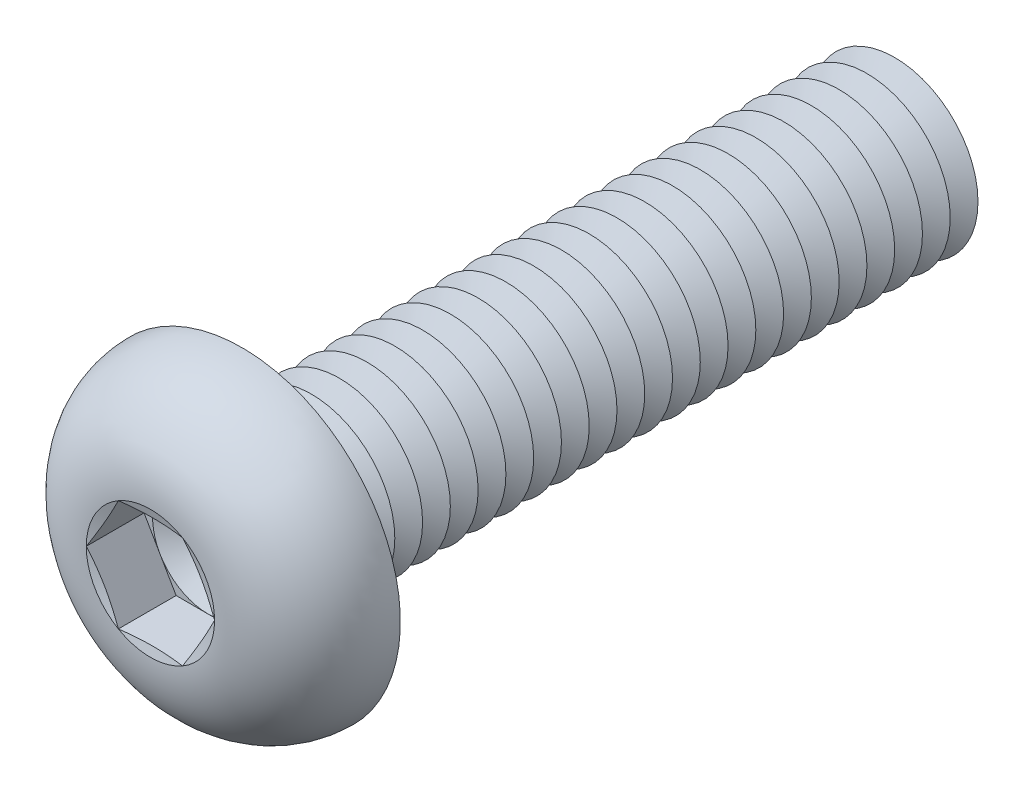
ISO-10303-21;
HEADER;
FILE_DESCRIPTION(('STEP AP214'),'2;1');
FILE_NAME('part.step','',(''),(''),'','','');
FILE_SCHEMA(('AUTOMOTIVE_DESIGN { 1 0 10303 214 1 1 1 1 }'));
ENDSEC;
DATA;
#1=APPLICATION_CONTEXT('core data for automotive mechanical design processes');
#2=APPLICATION_PROTOCOL_DEFINITION('international standard','automotive_design',2000,#1);
#3=PRODUCT_CONTEXT('',#1,'mechanical');
#4=PRODUCT('Part','Part','',(#3));
#5=PRODUCT_RELATED_PRODUCT_CATEGORY('part','',(#4));
#6=PRODUCT_DEFINITION_FORMATION('','',#4);
#7=PRODUCT_DEFINITION_CONTEXT('part definition',#1,'design');
#8=PRODUCT_DEFINITION('design','',#6,#7);
#9=PRODUCT_DEFINITION_SHAPE('','',#8);
#10=(LENGTH_UNIT() NAMED_UNIT(*) SI_UNIT(.MILLI.,.METRE.));
#11=(NAMED_UNIT(*) PLANE_ANGLE_UNIT() SI_UNIT($,.RADIAN.));
#12=(NAMED_UNIT(*) SI_UNIT($,.STERADIAN.) SOLID_ANGLE_UNIT());
#13=UNCERTAINTY_MEASURE_WITH_UNIT(LENGTH_MEASURE(1.E-05),#10,'distance_accuracy_value','');
#14=(GEOMETRIC_REPRESENTATION_CONTEXT(3) GLOBAL_UNCERTAINTY_ASSIGNED_CONTEXT((#13)) GLOBAL_UNIT_ASSIGNED_CONTEXT((#10,
#11,#12)) REPRESENTATION_CONTEXT('',''));
#15=CARTESIAN_POINT('',(0.,0.,0.));
#16=DIRECTION('',(0.,0.,1.));
#17=DIRECTION('',(1.,0.,0.));
#18=AXIS2_PLACEMENT_3D('',#15,#16,#17);
#19=CARTESIAN_POINT('',(0.,0.,0.609999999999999));
#20=DIRECTION('',(0.,0.,1.));
#21=DIRECTION('',(1.,0.,0.));
#22=AXIS2_PLACEMENT_3D('',#19,#20,#21);
#23=PLANE('',#22);
#24=CARTESIAN_POINT('',(0.,0.,0.609999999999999));
#25=DIRECTION('',(0.,0.,1.));
#26=DIRECTION('',(1.,0.,0.));
#27=AXIS2_PLACEMENT_3D('',#24,#25,#26);
#28=CIRCLE('',#27,0.999999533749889);
#29=CARTESIAN_POINT('',(0.866024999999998,0.499999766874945,0.609999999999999));
#30=VERTEX_POINT('',#29);
#31=CARTESIAN_POINT('',(0.,0.999999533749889,0.609999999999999));
#32=VERTEX_POINT('',#31);
#33=EDGE_CURVE('E118',#30,#32,#28,.T.);
#34=ORIENTED_EDGE('',*,*,#33,.F.);
#35=DIRECTION('',(-0.500000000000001,0.866025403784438,0.));
#36=VECTOR('',#35,1.);
#37=CARTESIAN_POINT('',(1.1547,0.,0.609999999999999));
#38=LINE('',#37,#36);
#39=CARTESIAN_POINT('',(0.577349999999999,0.999999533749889,0.609999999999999));
#40=VERTEX_POINT('',#39);
#41=EDGE_CURVE('E125',#30,#40,#38,.T.);
#42=ORIENTED_EDGE('',*,*,#41,.T.);
#43=DIRECTION('',(-1.,0.,0.));
#44=VECTOR('',#43,1.);
#45=CARTESIAN_POINT('',(0.577349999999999,0.999999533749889,0.609999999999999));
#46=LINE('',#45,#44);
#47=EDGE_CURVE('E136',#40,#32,#46,.T.);
#48=ORIENTED_EDGE('',*,*,#47,.T.);
#49=EDGE_LOOP('',(#34,#42,#48));
#50=FACE_BOUND('',#49,.T.);
#51=ADVANCED_FACE('F39',(#50),#23,.T.);
#52=CARTESIAN_POINT('',(0.,0.,0.609999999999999));
#53=DIRECTION('',(0.,0.,1.));
#54=DIRECTION('',(1.,0.,0.));
#55=AXIS2_PLACEMENT_3D('',#52,#53,#54);
#56=CIRCLE('',#55,0.999999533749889);
#57=CARTESIAN_POINT('',(-0.866024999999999,0.499999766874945,0.609999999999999));
#58=VERTEX_POINT('',#57);
#59=EDGE_CURVE('E11',#32,#58,#56,.T.);
#60=ORIENTED_EDGE('',*,*,#59,.F.);
#61=CARTESIAN_POINT('',(-0.577350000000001,0.999999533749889,0.609999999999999));
#62=VERTEX_POINT('',#61);
#63=EDGE_CURVE('E131',#32,#62,#46,.T.);
#64=ORIENTED_EDGE('',*,*,#63,.T.);
#65=DIRECTION('',(-0.5,-0.866025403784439,0.));
#66=VECTOR('',#65,1.);
#67=CARTESIAN_POINT('',(-0.577350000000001,0.999999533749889,0.609999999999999));
#68=LINE('',#67,#66);
#69=EDGE_CURVE('E134',#62,#58,#68,.T.);
#70=ORIENTED_EDGE('',*,*,#69,.T.);
#71=EDGE_LOOP('',(#60,#64,#70));
#72=FACE_BOUND('',#71,.T.);
#73=ADVANCED_FACE('F130',(#72),#23,.T.);
#74=CARTESIAN_POINT('',(-0.866024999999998,-0.499999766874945,0.609999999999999));
#75=VERTEX_POINT('',#74);
#76=EDGE_CURVE('E49',#58,#75,#56,.T.);
#77=ORIENTED_EDGE('',*,*,#76,.F.);
#78=CARTESIAN_POINT('',(-1.1547,0.,0.609999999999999));
#79=VERTEX_POINT('',#78);
#80=EDGE_CURVE('E143',#58,#79,#68,.T.);
#81=ORIENTED_EDGE('',*,*,#80,.T.);
#82=DIRECTION('',(0.5,-0.866025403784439,0.));
#83=VECTOR('',#82,1.);
#84=CARTESIAN_POINT('',(-1.1547,0.,0.609999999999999));
#85=LINE('',#84,#83);
#86=EDGE_CURVE('E152',#79,#75,#85,.T.);
#87=ORIENTED_EDGE('',*,*,#86,.T.);
#88=EDGE_LOOP('',(#77,#81,#87));
#89=FACE_BOUND('',#88,.T.);
#90=ADVANCED_FACE('F459',(#89),#23,.T.);
#91=CARTESIAN_POINT('',(0.,-0.999999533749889,0.609999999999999));
#92=VERTEX_POINT('',#91);
#93=EDGE_CURVE('E444',#75,#92,#56,.T.);
#94=ORIENTED_EDGE('',*,*,#93,.F.);
#95=CARTESIAN_POINT('',(-0.577349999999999,-0.99999953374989,0.609999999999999));
#96=VERTEX_POINT('',#95);
#97=EDGE_CURVE('E151',#75,#96,#85,.T.);
#98=ORIENTED_EDGE('',*,*,#97,.T.);
#99=DIRECTION('',(1.,0.,0.));
#100=VECTOR('',#99,1.);
#101=CARTESIAN_POINT('',(-0.577349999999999,-0.99999953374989,0.609999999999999));
#102=LINE('',#101,#100);
#103=EDGE_CURVE('E157',#96,#92,#102,.T.);
#104=ORIENTED_EDGE('',*,*,#103,.T.);
#105=EDGE_LOOP('',(#94,#98,#104));
#106=FACE_BOUND('',#105,.T.);
#107=ADVANCED_FACE('F452',(#106),#23,.T.);
#108=CARTESIAN_POINT('',(0.866024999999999,-0.499999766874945,0.609999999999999));
#109=VERTEX_POINT('',#108);
#110=EDGE_CURVE('E56',#92,#109,#56,.T.);
#111=ORIENTED_EDGE('',*,*,#110,.F.);
#112=CARTESIAN_POINT('',(0.577349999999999,-0.99999953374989,0.609999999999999));
#113=VERTEX_POINT('',#112);
#114=EDGE_CURVE('E156',#92,#113,#102,.T.);
#115=ORIENTED_EDGE('',*,*,#114,.T.);
#116=DIRECTION('',(0.5,0.866025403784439,0.));
#117=VECTOR('',#116,1.);
#118=CARTESIAN_POINT('',(0.577349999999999,-0.99999953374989,0.609999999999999));
#119=LINE('',#118,#117);
#120=EDGE_CURVE('E162',#113,#109,#119,.T.);
#121=ORIENTED_EDGE('',*,*,#120,.T.);
#122=EDGE_LOOP('',(#111,#115,#121));
#123=FACE_BOUND('',#122,.T.);
#124=ADVANCED_FACE('F531',(#123),#23,.T.);
#125=CARTESIAN_POINT('',(0.,0.,1.65));
#126=DIRECTION('',(0.,0.,1.));
#127=DIRECTION('',(1.,0.,0.));
#128=AXIS2_PLACEMENT_3D('',#125,#126,#127);
#129=CONICAL_SURFACE('',#128,1.1547,1.30899693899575);
#130=CARTESIAN_POINT('',(1.15481547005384,-0.000199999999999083,1.65003094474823));
#131=CARTESIAN_POINT('',(1.13083002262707,0.0413440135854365,1.64359970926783));
#132=CARTESIAN_POINT('',(1.10680107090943,0.0829633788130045,1.63776108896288));
#133=CARTESIAN_POINT('',(1.05865826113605,0.166349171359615,1.62750303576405));
#134=CARTESIAN_POINT('',(1.03454437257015,0.208115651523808,1.62308418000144));
#135=CARTESIAN_POINT('',(0.986377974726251,0.291542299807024,1.61592375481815));
#136=CARTESIAN_POINT('',(0.962325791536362,0.333201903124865,1.61317364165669));
#137=CARTESIAN_POINT('',(0.914190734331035,0.416574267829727,1.60948600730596));
#138=CARTESIAN_POINT('',(0.890107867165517,0.458287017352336,1.60854813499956));
#139=CARTESIAN_POINT('',(0.841942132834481,0.541712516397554,1.60854813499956));
#140=CARTESIAN_POINT('',(0.817859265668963,0.583425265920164,1.60948600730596));
#141=CARTESIAN_POINT('',(0.769724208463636,0.666797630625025,1.61317364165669));
#142=CARTESIAN_POINT('',(0.745672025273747,0.708457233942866,1.61592375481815));
#143=CARTESIAN_POINT('',(0.697505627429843,0.791883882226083,1.62308418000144));
#144=CARTESIAN_POINT('',(0.673391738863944,0.833650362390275,1.62750303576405));
#145=CARTESIAN_POINT('',(0.625248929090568,0.917036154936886,1.63776108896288));
#146=CARTESIAN_POINT('',(0.60121997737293,0.958655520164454,1.64359970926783));
#147=CARTESIAN_POINT('',(0.577234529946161,1.00019953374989,1.65003094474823));
#148=B_SPLINE_CURVE_WITH_KNOTS('',3,(#130,#131,#132,#133,#134,#135,#136,#137,#138,#139,#140,
#141,#142,#143,#144,#145,#146,#147),.UNSPECIFIED.,.F.,.F.,(4,2,2,2,2,2,2,2,4),(0.,
0.145207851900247,0.290474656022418,0.434991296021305,0.579479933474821,0.723968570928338,
0.868485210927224,1.0137520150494,1.15895986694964),.UNSPECIFIED.);
#149=CARTESIAN_POINT('',(1.1547,0.,1.65));
#150=VERTEX_POINT('',#149);
#151=CARTESIAN_POINT('',(0.57735,0.99999953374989,1.65));
#152=VERTEX_POINT('',#151);
#153=EDGE_CURVE('E220',#150,#152,#148,.T.);
#154=ORIENTED_EDGE('',*,*,#153,.F.);
#155=CARTESIAN_POINT('',(0.,0.,1.65));
#156=DIRECTION('',(0.,0.,-1.));
#157=DIRECTION('',(-1.,0.,0.));
#158=AXIS2_PLACEMENT_3D('',#155,#156,#157);
#159=CIRCLE('',#158,1.1547);
#160=EDGE_CURVE('E489',#152,#150,#159,.T.);
#161=ORIENTED_EDGE('',*,*,#160,.F.);
#162=EDGE_LOOP('',(#154,#161));
#163=FACE_BOUND('',#162,.T.);
#164=ADVANCED_FACE('F535',(#163),#129,.F.);
#165=CARTESIAN_POINT('',(0.577234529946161,-1.00019953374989,1.65003094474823));
#166=CARTESIAN_POINT('',(0.60121997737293,-0.958655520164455,1.64359970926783));
#167=CARTESIAN_POINT('',(0.625248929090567,-0.917036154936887,1.63776108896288));
#168=CARTESIAN_POINT('',(0.673391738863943,-0.833650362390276,1.62750303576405));
#169=CARTESIAN_POINT('',(0.697505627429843,-0.791883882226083,1.62308418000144));
#170=CARTESIAN_POINT('',(0.745672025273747,-0.708457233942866,1.61592375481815));
#171=CARTESIAN_POINT('',(0.769724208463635,-0.666797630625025,1.61317364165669));
#172=CARTESIAN_POINT('',(0.817859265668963,-0.583425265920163,1.60948600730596));
#173=CARTESIAN_POINT('',(0.84194213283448,-0.541712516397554,1.60854813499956));
#174=CARTESIAN_POINT('',(0.890107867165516,-0.458287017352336,1.60854813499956));
#175=CARTESIAN_POINT('',(0.914190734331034,-0.416574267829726,1.60948600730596));
#176=CARTESIAN_POINT('',(0.962325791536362,-0.333201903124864,1.61317364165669));
#177=CARTESIAN_POINT('',(0.98637797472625,-0.291542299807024,1.61592375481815));
#178=CARTESIAN_POINT('',(1.03454437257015,-0.208115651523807,1.62308418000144));
#179=CARTESIAN_POINT('',(1.05865826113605,-0.166349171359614,1.62750303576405));
#180=CARTESIAN_POINT('',(1.10680107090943,-0.0829633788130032,1.63776108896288));
#181=CARTESIAN_POINT('',(1.13083002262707,-0.0413440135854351,1.64359970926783));
#182=CARTESIAN_POINT('',(1.15481547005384,0.000200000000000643,1.65003094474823));
#183=B_SPLINE_CURVE_WITH_KNOTS('',3,(#165,#166,#167,#168,#169,#170,#171,#172,#173,#174,#175,
#176,#177,#178,#179,#180,#181,#182),.UNSPECIFIED.,.F.,.F.,(4,2,2,2,2,2,2,2,4),(0.,
0.145207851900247,0.290474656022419,0.434991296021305,0.579479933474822,0.723968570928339,
0.868485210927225,1.0137520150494,1.15895986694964),.UNSPECIFIED.);
#184=CARTESIAN_POINT('',(0.577349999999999,-0.99999953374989,1.65));
#185=VERTEX_POINT('',#184);
#186=EDGE_CURVE('E229',#185,#150,#183,.T.);
#187=ORIENTED_EDGE('',*,*,#186,.F.);
#188=EDGE_CURVE('E491',#150,#185,#159,.T.);
#189=ORIENTED_EDGE('',*,*,#188,.F.);
#190=EDGE_LOOP('',(#187,#189));
#191=FACE_BOUND('',#190,.T.);
#192=ADVANCED_FACE('F541',(#191),#129,.F.);
#193=CARTESIAN_POINT('',(-1.7425668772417,-0.99999953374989,1.87893949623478));
#194=CARTESIAN_POINT('',(-1.65819693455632,-0.99999953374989,1.85935934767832));
#195=CARTESIAN_POINT('',(-1.57375647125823,-0.99999953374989,1.84006351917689));
#196=CARTESIAN_POINT('',(-1.40464514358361,-0.99999953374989,1.80242908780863));
#197=CARTESIAN_POINT('',(-1.31997423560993,-0.99999953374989,1.78409068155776));
#198=CARTESIAN_POINT('',(-1.14955192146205,-0.99999953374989,1.74860242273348));
#199=CARTESIAN_POINT('',(-1.06379782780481,-0.99999953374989,1.73146532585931));
#200=CARTESIAN_POINT('',(-0.891887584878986,-0.99999953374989,1.69925819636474));
#201=CARTESIAN_POINT('',(-0.805731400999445,-0.99999953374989,1.68418834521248));
#202=CARTESIAN_POINT('',(-0.635256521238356,-0.99999953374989,1.65751615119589));
#203=CARTESIAN_POINT('',(-0.550951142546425,-0.99999953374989,1.64583105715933));
#204=CARTESIAN_POINT('',(-0.381865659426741,-0.99999953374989,1.62668811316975));
#205=CARTESIAN_POINT('',(-0.297085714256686,-0.99999953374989,1.61922892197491));
#206=CARTESIAN_POINT('',(-0.127577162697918,-0.99999953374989,1.60981453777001));
#207=CARTESIAN_POINT('',(-0.0428499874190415,-0.99999953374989,1.60783514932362));
#208=CARTESIAN_POINT('',(0.126542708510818,-0.99999953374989,1.60973012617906));
#209=CARTESIAN_POINT('',(0.211208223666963,-0.99999953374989,1.61360496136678));
#210=CARTESIAN_POINT('',(0.356115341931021,-0.99999953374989,1.62460226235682));
#211=CARTESIAN_POINT('',(0.416458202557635,-0.99999953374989,1.63048841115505));
#212=CARTESIAN_POINT('',(0.536893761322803,-0.99999953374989,1.64437752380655));
#213=CARTESIAN_POINT('',(0.596986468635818,-0.99999953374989,1.65238040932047));
#214=CARTESIAN_POINT('',(0.777275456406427,-0.99999953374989,1.67888855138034));
#215=CARTESIAN_POINT('',(0.897104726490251,-0.99999953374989,1.69985858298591));
#216=CARTESIAN_POINT('',(1.07751611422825,-0.99999953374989,1.73433574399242));
#217=CARTESIAN_POINT('',(1.1383777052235,-0.99999953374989,1.74646914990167));
#218=CARTESIAN_POINT('',(1.25994955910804,-0.99999953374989,1.7714845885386));
#219=CARTESIAN_POINT('',(1.32065982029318,-0.99999953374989,1.7843666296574));
#220=CARTESIAN_POINT('',(1.44162663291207,-0.99999953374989,1.81062164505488));
#221=CARTESIAN_POINT('',(1.50188385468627,-0.99999953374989,1.82399156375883));
#222=CARTESIAN_POINT('',(1.62229550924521,-0.99999953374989,1.85116781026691));
#223=CARTESIAN_POINT('',(1.68244994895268,-0.99999953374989,1.86497410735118));
#224=CARTESIAN_POINT('',(1.7425668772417,-0.99999953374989,1.87893949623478));
#225=B_SPLINE_CURVE_WITH_KNOTS('',3,(#193,#194,#195,#196,#197,#198,#199,#200,#201,#202,#203,
#204,#205,#206,#207,#208,#209,#210,#211,#212,#213,#214,#215,#216,#217,#218,#219,#220,#221,#222,
#223,#224),.UNSPECIFIED.,.F.,.F.,(4,2,2,2,2,2,2,2,2,2,2,2,2,2,2,4),(0.,0.259842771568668,
0.519738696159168,0.782071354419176,1.04442702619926,1.29968778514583,1.55486748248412,
1.80891865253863,2.06299021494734,2.24483732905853,2.42667771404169,2.79149503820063,
2.97767344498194,3.16385393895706,3.34902052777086,3.53417411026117),.UNSPECIFIED.);
#226=CARTESIAN_POINT('',(-0.577349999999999,-0.99999953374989,1.65));
#227=VERTEX_POINT('',#226);
#228=EDGE_CURVE('E471',#227,#185,#225,.T.);
#229=ORIENTED_EDGE('',*,*,#228,.F.);
#230=EDGE_CURVE('E479',#185,#227,#159,.T.);
#231=ORIENTED_EDGE('',*,*,#230,.F.);
#232=EDGE_LOOP('',(#229,#231));
#233=FACE_BOUND('',#232,.T.);
#234=ADVANCED_FACE('F551',(#233),#129,.F.);
#235=CARTESIAN_POINT('',(-1.15481547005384,0.000200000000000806,1.65003094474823));
#236=CARTESIAN_POINT('',(-1.13083002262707,-0.041344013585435,1.64359970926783));
#237=CARTESIAN_POINT('',(-1.10680107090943,-0.0829633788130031,1.63776108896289));
#238=CARTESIAN_POINT('',(-1.05865826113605,-0.166349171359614,1.62750303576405));
#239=CARTESIAN_POINT('',(-1.03454437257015,-0.208115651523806,1.62308418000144));
#240=CARTESIAN_POINT('',(-0.986377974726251,-0.291542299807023,1.61592375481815));
#241=CARTESIAN_POINT('',(-0.962325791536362,-0.333201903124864,1.61317364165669));
#242=CARTESIAN_POINT('',(-0.914190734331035,-0.416574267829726,1.60948600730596));
#243=CARTESIAN_POINT('',(-0.890107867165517,-0.458287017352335,1.60854813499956));
#244=CARTESIAN_POINT('',(-0.841942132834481,-0.541712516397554,1.60854813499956));
#245=CARTESIAN_POINT('',(-0.817859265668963,-0.583425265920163,1.60948600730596));
#246=CARTESIAN_POINT('',(-0.769724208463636,-0.666797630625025,1.61317364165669));
#247=CARTESIAN_POINT('',(-0.745672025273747,-0.708457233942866,1.61592375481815));
#248=CARTESIAN_POINT('',(-0.697505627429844,-0.791883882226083,1.62308418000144));
#249=CARTESIAN_POINT('',(-0.673391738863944,-0.833650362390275,1.62750303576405));
#250=CARTESIAN_POINT('',(-0.625248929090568,-0.917036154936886,1.63776108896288));
#251=CARTESIAN_POINT('',(-0.60121997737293,-0.958655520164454,1.64359970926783));
#252=CARTESIAN_POINT('',(-0.577234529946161,-1.00019953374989,1.65003094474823));
#253=B_SPLINE_CURVE_WITH_KNOTS('',3,(#235,#236,#237,#238,#239,#240,#241,#242,#243,#244,#245,
#246,#247,#248,#249,#250,#251,#252),.UNSPECIFIED.,.F.,.F.,(4,2,2,2,2,2,2,2,4),(0.,
0.145207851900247,0.290474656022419,0.434991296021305,0.579479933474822,0.723968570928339,
0.868485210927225,1.0137520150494,1.15895986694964),.UNSPECIFIED.);
#254=CARTESIAN_POINT('',(-1.1547,0.,1.65));
#255=VERTEX_POINT('',#254);
#256=EDGE_CURVE('E464',#255,#227,#253,.T.);
#257=ORIENTED_EDGE('',*,*,#256,.F.);
#258=EDGE_CURVE('E427',#227,#255,#159,.T.);
#259=ORIENTED_EDGE('',*,*,#258,.F.);
#260=EDGE_LOOP('',(#257,#259));
#261=FACE_BOUND('',#260,.T.);
#262=ADVANCED_FACE('F468',(#261),#129,.F.);
#263=CARTESIAN_POINT('',(-0.577234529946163,1.00019953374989,1.65003094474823));
#264=CARTESIAN_POINT('',(-0.601219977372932,0.958655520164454,1.64359970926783));
#265=CARTESIAN_POINT('',(-0.625248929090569,0.917036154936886,1.63776108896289));
#266=CARTESIAN_POINT('',(-0.673391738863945,0.833650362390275,1.62750303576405));
#267=CARTESIAN_POINT('',(-0.697505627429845,0.791883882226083,1.62308418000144));
#268=CARTESIAN_POINT('',(-0.745672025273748,0.708457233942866,1.61592375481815));
#269=CARTESIAN_POINT('',(-0.769724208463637,0.666797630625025,1.61317364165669));
#270=CARTESIAN_POINT('',(-0.817859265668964,0.583425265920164,1.60948600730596));
#271=CARTESIAN_POINT('',(-0.841942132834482,0.541712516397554,1.60854813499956));
#272=CARTESIAN_POINT('',(-0.890107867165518,0.458287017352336,1.60854813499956));
#273=CARTESIAN_POINT('',(-0.914190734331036,0.416574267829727,1.60948600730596));
#274=CARTESIAN_POINT('',(-0.962325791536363,0.333201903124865,1.61317364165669));
#275=CARTESIAN_POINT('',(-0.986377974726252,0.291542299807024,1.61592375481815));
#276=CARTESIAN_POINT('',(-1.03454437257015,0.208115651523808,1.62308418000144));
#277=CARTESIAN_POINT('',(-1.05865826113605,0.166349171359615,1.62750303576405));
#278=CARTESIAN_POINT('',(-1.10680107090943,0.0829633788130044,1.63776108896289));
#279=CARTESIAN_POINT('',(-1.13083002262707,0.0413440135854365,1.64359970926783));
#280=CARTESIAN_POINT('',(-1.15481547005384,-0.000199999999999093,1.65003094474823));
#281=B_SPLINE_CURVE_WITH_KNOTS('',3,(#263,#264,#265,#266,#267,#268,#269,#270,#271,#272,#273,
#274,#275,#276,#277,#278,#279,#280),.UNSPECIFIED.,.F.,.F.,(4,2,2,2,2,2,2,2,4),(0.,
0.145207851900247,0.290474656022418,0.434991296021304,0.579479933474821,0.723968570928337,
0.868485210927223,1.01375201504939,1.15895986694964),.UNSPECIFIED.);
#282=CARTESIAN_POINT('',(-0.577350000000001,0.999999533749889,1.65));
#283=VERTEX_POINT('',#282);
#284=EDGE_CURVE('E194',#283,#255,#281,.T.);
#285=ORIENTED_EDGE('',*,*,#284,.F.);
#286=EDGE_CURVE('E428',#255,#283,#159,.T.);
#287=ORIENTED_EDGE('',*,*,#286,.F.);
#288=EDGE_LOOP('',(#285,#287));
#289=FACE_BOUND('',#288,.T.);
#290=ADVANCED_FACE('F482',(#289),#129,.F.);
#291=CARTESIAN_POINT('',(0.,0.,-10.25));
#292=DIRECTION('',(0.,0.,1.));
#293=DIRECTION('',(1.,0.,0.));
#294=AXIS2_PLACEMENT_3D('',#291,#292,#293);
#295=CONICAL_SURFACE('',#294,1.5,1.0471975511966);
#296=CARTESIAN_POINT('',(0.,0.,-10.5));
#297=DIRECTION('',(0.,0.,1.));
#298=DIRECTION('',(1.,0.,0.));
#299=AXIS2_PLACEMENT_3D('',#296,#297,#298);
#300=CIRCLE('',#299,1.06698729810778);
#301=CARTESIAN_POINT('',(1.06698729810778,0.,-10.5));
#302=VERTEX_POINT('',#301);
#303=EDGE_CURVE('E399',#302,#302,#300,.T.);
#304=ORIENTED_EDGE('',*,*,#303,.T.);
#305=EDGE_LOOP('',(#304));
#306=FACE_BOUND('',#305,.T.);
#307=CARTESIAN_POINT('',(0.,0.,-10.25));
#308=DIRECTION('',(0.,0.,1.));
#309=DIRECTION('',(1.,0.,0.));
#310=AXIS2_PLACEMENT_3D('',#307,#308,#309);
#311=CIRCLE('',#310,1.5);
#312=CARTESIAN_POINT('',(1.5,0.,-10.25));
#313=VERTEX_POINT('',#312);
#314=EDGE_CURVE('E395',#313,#313,#311,.T.);
#315=ORIENTED_EDGE('',*,*,#314,.F.);
#316=EDGE_LOOP('',(#315));
#317=FACE_BOUND('',#316,.T.);
#318=ADVANCED_FACE('F617',(#306,#317),#295,.T.);
#319=CARTESIAN_POINT('',(0.,0.,-10.5));
#320=DIRECTION('',(0.,0.,-1.));
#321=DIRECTION('',(-1.,0.,0.));
#322=AXIS2_PLACEMENT_3D('',#319,#320,#321);
#323=CONICAL_SURFACE('',#322,1.06698729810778,1.0471975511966);
#324=CARTESIAN_POINT('',(0.,0.,-10.75));
#325=DIRECTION('',(0.,0.,1.));
#326=DIRECTION('',(1.,0.,0.));
#327=AXIS2_PLACEMENT_3D('',#324,#325,#326);
#328=CIRCLE('',#327,1.5);
#329=CARTESIAN_POINT('',(1.5,0.,-10.75));
#330=VERTEX_POINT('',#329);
#331=EDGE_CURVE('E403',#330,#330,#328,.T.);
#332=ORIENTED_EDGE('',*,*,#331,.T.);
#333=EDGE_LOOP('',(#332));
#334=FACE_BOUND('',#333,.T.);
#335=ORIENTED_EDGE('',*,*,#303,.F.);
#336=EDGE_LOOP('',(#335));
#337=FACE_BOUND('',#336,.T.);
#338=ADVANCED_FACE('F1024',(#334,#337),#323,.T.);
#339=CARTESIAN_POINT('',(0.,1.50000000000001,-12.));
#340=DIRECTION('',(0.,0.,-1.));
#341=DIRECTION('',(-1.,0.,0.));
#342=AXIS2_PLACEMENT_3D('',#339,#340,#341);
#343=PLANE('',#342);
#344=CARTESIAN_POINT('',(0.,0.,-12.));
#345=DIRECTION('',(0.,0.,1.));
#346=DIRECTION('',(1.,0.,0.));
#347=AXIS2_PLACEMENT_3D('',#344,#345,#346);
#348=CIRCLE('',#347,1.06698729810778);
#349=CARTESIAN_POINT('',(1.06698729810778,0.,-12.));
#350=VERTEX_POINT('',#349);
#351=EDGE_CURVE('E423',#350,#350,#348,.T.);
#352=ORIENTED_EDGE('',*,*,#351,.F.);
#353=EDGE_LOOP('',(#352));
#354=FACE_BOUND('',#353,.T.);
#355=ADVANCED_FACE('F1018',(#354),#343,.T.);
#356=CARTESIAN_POINT('',(0.,0.,-11.75));
#357=DIRECTION('',(0.,0.,1.));
#358=DIRECTION('',(1.,0.,0.));
#359=AXIS2_PLACEMENT_3D('',#356,#357,#358);
#360=CONICAL_SURFACE('',#359,1.5,1.0471975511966);
#361=ORIENTED_EDGE('',*,*,#351,.T.);
#362=EDGE_LOOP('',(#361));
#363=FACE_BOUND('',#362,.T.);
#364=CARTESIAN_POINT('',(0.,0.,-11.75));
#365=DIRECTION('',(0.,0.,1.));
#366=DIRECTION('',(1.,0.,0.));
#367=AXIS2_PLACEMENT_3D('',#364,#365,#366);
#368=CIRCLE('',#367,1.5);
#369=CARTESIAN_POINT('',(1.5,0.,-11.75));
#370=VERTEX_POINT('',#369);
#371=EDGE_CURVE('E419',#370,#370,#368,.T.);
#372=ORIENTED_EDGE('',*,*,#371,.F.);
#373=EDGE_LOOP('',(#372));
#374=FACE_BOUND('',#373,.T.);
#375=ADVANCED_FACE('F1011',(#363,#374),#360,.T.);
#376=CARTESIAN_POINT('',(0.,0.,-11.5));
#377=DIRECTION('',(0.,0.,-1.));
#378=DIRECTION('',(-1.,0.,0.));
#379=AXIS2_PLACEMENT_3D('',#376,#377,#378);
#380=CONICAL_SURFACE('',#379,1.06698729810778,1.0471975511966);
#381=ORIENTED_EDGE('',*,*,#371,.T.);
#382=EDGE_LOOP('',(#381));
#383=FACE_BOUND('',#382,.T.);
#384=CARTESIAN_POINT('',(0.,0.,-11.5));
#385=DIRECTION('',(0.,0.,1.));
#386=DIRECTION('',(1.,0.,0.));
#387=AXIS2_PLACEMENT_3D('',#384,#385,#386);
#388=CIRCLE('',#387,1.06698729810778);
#389=CARTESIAN_POINT('',(1.06698729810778,0.,-11.5));
#390=VERTEX_POINT('',#389);
#391=EDGE_CURVE('E415',#390,#390,#388,.T.);
#392=ORIENTED_EDGE('',*,*,#391,.F.);
#393=EDGE_LOOP('',(#392));
#394=FACE_BOUND('',#393,.T.);
#395=ADVANCED_FACE('F1004',(#383,#394),#380,.T.);
#396=CARTESIAN_POINT('',(0.,0.,-11.25));
#397=DIRECTION('',(0.,0.,1.));
#398=DIRECTION('',(1.,0.,0.));
#399=AXIS2_PLACEMENT_3D('',#396,#397,#398);
#400=CONICAL_SURFACE('',#399,1.5,1.0471975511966);
#401=ORIENTED_EDGE('',*,*,#391,.T.);
#402=EDGE_LOOP('',(#401));
#403=FACE_BOUND('',#402,.T.);
#404=CARTESIAN_POINT('',(0.,0.,-11.25));
#405=DIRECTION('',(0.,0.,1.));
#406=DIRECTION('',(1.,0.,0.));
#407=AXIS2_PLACEMENT_3D('',#404,#405,#406);
#408=CIRCLE('',#407,1.5);
#409=CARTESIAN_POINT('',(1.5,0.,-11.25));
#410=VERTEX_POINT('',#409);
#411=EDGE_CURVE('E411',#410,#410,#408,.T.);
#412=ORIENTED_EDGE('',*,*,#411,.F.);
#413=EDGE_LOOP('',(#412));
#414=FACE_BOUND('',#413,.T.);
#415=ADVANCED_FACE('F997',(#403,#414),#400,.T.);
#416=CARTESIAN_POINT('',(0.,0.,-11.));
#417=DIRECTION('',(0.,0.,-1.));
#418=DIRECTION('',(-1.,0.,0.));
#419=AXIS2_PLACEMENT_3D('',#416,#417,#418);
#420=CONICAL_SURFACE('',#419,1.06698729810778,1.0471975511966);
#421=ORIENTED_EDGE('',*,*,#411,.T.);
#422=EDGE_LOOP('',(#421));
#423=FACE_BOUND('',#422,.T.);
#424=CARTESIAN_POINT('',(0.,0.,-11.));
#425=DIRECTION('',(0.,0.,1.));
#426=DIRECTION('',(1.,0.,0.));
#427=AXIS2_PLACEMENT_3D('',#424,#425,#426);
#428=CIRCLE('',#427,1.06698729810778);
#429=CARTESIAN_POINT('',(1.06698729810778,0.,-11.));
#430=VERTEX_POINT('',#429);
#431=EDGE_CURVE('E407',#430,#430,#428,.T.);
#432=ORIENTED_EDGE('',*,*,#431,.F.);
#433=EDGE_LOOP('',(#432));
#434=FACE_BOUND('',#433,.T.);
#435=ADVANCED_FACE('F990',(#423,#434),#420,.T.);
#436=CARTESIAN_POINT('',(0.,0.,-10.75));
#437=DIRECTION('',(0.,0.,1.));
#438=DIRECTION('',(1.,0.,0.));
#439=AXIS2_PLACEMENT_3D('',#436,#437,#438);
#440=CONICAL_SURFACE('',#439,1.5,1.0471975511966);
#441=ORIENTED_EDGE('',*,*,#431,.T.);
#442=EDGE_LOOP('',(#441));
#443=FACE_BOUND('',#442,.T.);
#444=ORIENTED_EDGE('',*,*,#331,.F.);
#445=EDGE_LOOP('',(#444));
#446=FACE_BOUND('',#445,.T.);
#447=ADVANCED_FACE('F983',(#443,#446),#440,.T.);
#448=CARTESIAN_POINT('',(0.,0.,-9.75));
#449=DIRECTION('',(0.,0.,1.));
#450=DIRECTION('',(1.,0.,0.));
#451=AXIS2_PLACEMENT_3D('',#448,#449,#450);
#452=CONICAL_SURFACE('',#451,1.5,1.0471975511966);
#453=CARTESIAN_POINT('',(0.,0.,-10.));
#454=DIRECTION('',(0.,0.,1.));
#455=DIRECTION('',(1.,0.,0.));
#456=AXIS2_PLACEMENT_3D('',#453,#454,#455);
#457=CIRCLE('',#456,1.06698729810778);
#458=CARTESIAN_POINT('',(1.06698729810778,0.,-10.));
#459=VERTEX_POINT('',#458);
#460=EDGE_CURVE('E391',#459,#459,#457,.T.);
#461=ORIENTED_EDGE('',*,*,#460,.T.);
#462=EDGE_LOOP('',(#461));
#463=FACE_BOUND('',#462,.T.);
#464=CARTESIAN_POINT('',(0.,0.,-9.75));
#465=DIRECTION('',(0.,0.,1.));
#466=DIRECTION('',(1.,0.,0.));
#467=AXIS2_PLACEMENT_3D('',#464,#465,#466);
#468=CIRCLE('',#467,1.5);
#469=CARTESIAN_POINT('',(1.5,0.,-9.75));
#470=VERTEX_POINT('',#469);
#471=EDGE_CURVE('E387',#470,#470,#468,.T.);
#472=ORIENTED_EDGE('',*,*,#471,.F.);
#473=EDGE_LOOP('',(#472));
#474=FACE_BOUND('',#473,.T.);
#475=ADVANCED_FACE('F976',(#463,#474),#452,.T.);
#476=CARTESIAN_POINT('',(0.,0.,-10.));
#477=DIRECTION('',(0.,0.,-1.));
#478=DIRECTION('',(-1.,0.,0.));
#479=AXIS2_PLACEMENT_3D('',#476,#477,#478);
#480=CONICAL_SURFACE('',#479,1.06698729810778,1.0471975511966);
#481=ORIENTED_EDGE('',*,*,#314,.T.);
#482=EDGE_LOOP('',(#481));
#483=FACE_BOUND('',#482,.T.);
#484=ORIENTED_EDGE('',*,*,#460,.F.);
#485=EDGE_LOOP('',(#484));
#486=FACE_BOUND('',#485,.T.);
#487=ADVANCED_FACE('F969',(#483,#486),#480,.T.);
#488=CARTESIAN_POINT('',(0.,0.,-9.25));
#489=DIRECTION('',(0.,0.,1.));
#490=DIRECTION('',(1.,0.,0.));
#491=AXIS2_PLACEMENT_3D('',#488,#489,#490);
#492=CONICAL_SURFACE('',#491,1.5,1.0471975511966);
#493=CARTESIAN_POINT('',(0.,0.,-9.5));
#494=DIRECTION('',(0.,0.,1.));
#495=DIRECTION('',(1.,0.,0.));
#496=AXIS2_PLACEMENT_3D('',#493,#494,#495);
#497=CIRCLE('',#496,1.06698729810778);
#498=CARTESIAN_POINT('',(1.06698729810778,0.,-9.5));
#499=VERTEX_POINT('',#498);
#500=EDGE_CURVE('E383',#499,#499,#497,.T.);
#501=ORIENTED_EDGE('',*,*,#500,.T.);
#502=EDGE_LOOP('',(#501));
#503=FACE_BOUND('',#502,.T.);
#504=CARTESIAN_POINT('',(0.,0.,-9.25));
#505=DIRECTION('',(0.,0.,1.));
#506=DIRECTION('',(1.,0.,0.));
#507=AXIS2_PLACEMENT_3D('',#504,#505,#506);
#508=CIRCLE('',#507,1.5);
#509=CARTESIAN_POINT('',(1.5,0.,-9.25));
#510=VERTEX_POINT('',#509);
#511=EDGE_CURVE('E379',#510,#510,#508,.T.);
#512=ORIENTED_EDGE('',*,*,#511,.F.);
#513=EDGE_LOOP('',(#512));
#514=FACE_BOUND('',#513,.T.);
#515=ADVANCED_FACE('F962',(#503,#514),#492,.T.);
#516=CARTESIAN_POINT('',(0.,0.,-9.5));
#517=DIRECTION('',(0.,0.,-1.));
#518=DIRECTION('',(-1.,0.,0.));
#519=AXIS2_PLACEMENT_3D('',#516,#517,#518);
#520=CONICAL_SURFACE('',#519,1.06698729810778,1.0471975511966);
#521=ORIENTED_EDGE('',*,*,#471,.T.);
#522=EDGE_LOOP('',(#521));
#523=FACE_BOUND('',#522,.T.);
#524=ORIENTED_EDGE('',*,*,#500,.F.);
#525=EDGE_LOOP('',(#524));
#526=FACE_BOUND('',#525,.T.);
#527=ADVANCED_FACE('F955',(#523,#526),#520,.T.);
#528=CARTESIAN_POINT('',(0.,0.,-8.75));
#529=DIRECTION('',(0.,0.,1.));
#530=DIRECTION('',(1.,0.,0.));
#531=AXIS2_PLACEMENT_3D('',#528,#529,#530);
#532=CONICAL_SURFACE('',#531,1.5,1.0471975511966);
#533=CARTESIAN_POINT('',(0.,0.,-9.));
#534=DIRECTION('',(0.,0.,1.));
#535=DIRECTION('',(1.,0.,0.));
#536=AXIS2_PLACEMENT_3D('',#533,#534,#535);
#537=CIRCLE('',#536,1.06698729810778);
#538=CARTESIAN_POINT('',(1.06698729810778,0.,-9.));
#539=VERTEX_POINT('',#538);
#540=EDGE_CURVE('E375',#539,#539,#537,.T.);
#541=ORIENTED_EDGE('',*,*,#540,.T.);
#542=EDGE_LOOP('',(#541));
#543=FACE_BOUND('',#542,.T.);
#544=CARTESIAN_POINT('',(0.,0.,-8.75));
#545=DIRECTION('',(0.,0.,1.));
#546=DIRECTION('',(1.,0.,0.));
#547=AXIS2_PLACEMENT_3D('',#544,#545,#546);
#548=CIRCLE('',#547,1.5);
#549=CARTESIAN_POINT('',(1.5,0.,-8.75));
#550=VERTEX_POINT('',#549);
#551=EDGE_CURVE('E371',#550,#550,#548,.T.);
#552=ORIENTED_EDGE('',*,*,#551,.F.);
#553=EDGE_LOOP('',(#552));
#554=FACE_BOUND('',#553,.T.);
#555=ADVANCED_FACE('F948',(#543,#554),#532,.T.);
#556=CARTESIAN_POINT('',(0.,0.,-9.));
#557=DIRECTION('',(0.,0.,-1.));
#558=DIRECTION('',(-1.,0.,0.));
#559=AXIS2_PLACEMENT_3D('',#556,#557,#558);
#560=CONICAL_SURFACE('',#559,1.06698729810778,1.0471975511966);
#561=ORIENTED_EDGE('',*,*,#511,.T.);
#562=EDGE_LOOP('',(#561));
#563=FACE_BOUND('',#562,.T.);
#564=ORIENTED_EDGE('',*,*,#540,.F.);
#565=EDGE_LOOP('',(#564));
#566=FACE_BOUND('',#565,.T.);
#567=ADVANCED_FACE('F941',(#563,#566),#560,.T.);
#568=CARTESIAN_POINT('',(0.,0.,-8.25));
#569=DIRECTION('',(0.,0.,1.));
#570=DIRECTION('',(1.,0.,0.));
#571=AXIS2_PLACEMENT_3D('',#568,#569,#570);
#572=CONICAL_SURFACE('',#571,1.5,1.0471975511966);
#573=CARTESIAN_POINT('',(0.,0.,-8.5));
#574=DIRECTION('',(0.,0.,1.));
#575=DIRECTION('',(1.,0.,0.));
#576=AXIS2_PLACEMENT_3D('',#573,#574,#575);
#577=CIRCLE('',#576,1.06698729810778);
#578=CARTESIAN_POINT('',(1.06698729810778,0.,-8.5));
#579=VERTEX_POINT('',#578);
#580=EDGE_CURVE('E367',#579,#579,#577,.T.);
#581=ORIENTED_EDGE('',*,*,#580,.T.);
#582=EDGE_LOOP('',(#581));
#583=FACE_BOUND('',#582,.T.);
#584=CARTESIAN_POINT('',(0.,0.,-8.25));
#585=DIRECTION('',(0.,0.,1.));
#586=DIRECTION('',(1.,0.,0.));
#587=AXIS2_PLACEMENT_3D('',#584,#585,#586);
#588=CIRCLE('',#587,1.5);
#589=CARTESIAN_POINT('',(1.5,0.,-8.25));
#590=VERTEX_POINT('',#589);
#591=EDGE_CURVE('E363',#590,#590,#588,.T.);
#592=ORIENTED_EDGE('',*,*,#591,.F.);
#593=EDGE_LOOP('',(#592));
#594=FACE_BOUND('',#593,.T.);
#595=ADVANCED_FACE('F934',(#583,#594),#572,.T.);
#596=CARTESIAN_POINT('',(0.,0.,-8.5));
#597=DIRECTION('',(0.,0.,-1.));
#598=DIRECTION('',(-1.,0.,0.));
#599=AXIS2_PLACEMENT_3D('',#596,#597,#598);
#600=CONICAL_SURFACE('',#599,1.06698729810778,1.0471975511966);
#601=ORIENTED_EDGE('',*,*,#551,.T.);
#602=EDGE_LOOP('',(#601));
#603=FACE_BOUND('',#602,.T.);
#604=ORIENTED_EDGE('',*,*,#580,.F.);
#605=EDGE_LOOP('',(#604));
#606=FACE_BOUND('',#605,.T.);
#607=ADVANCED_FACE('F927',(#603,#606),#600,.T.);
#608=CARTESIAN_POINT('',(0.,0.,-7.75));
#609=DIRECTION('',(0.,0.,1.));
#610=DIRECTION('',(1.,0.,0.));
#611=AXIS2_PLACEMENT_3D('',#608,#609,#610);
#612=CONICAL_SURFACE('',#611,1.5,1.0471975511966);
#613=CARTESIAN_POINT('',(0.,0.,-8.));
#614=DIRECTION('',(0.,0.,1.));
#615=DIRECTION('',(1.,0.,0.));
#616=AXIS2_PLACEMENT_3D('',#613,#614,#615);
#617=CIRCLE('',#616,1.06698729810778);
#618=CARTESIAN_POINT('',(1.06698729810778,0.,-8.));
#619=VERTEX_POINT('',#618);
#620=EDGE_CURVE('E359',#619,#619,#617,.T.);
#621=ORIENTED_EDGE('',*,*,#620,.T.);
#622=EDGE_LOOP('',(#621));
#623=FACE_BOUND('',#622,.T.);
#624=CARTESIAN_POINT('',(0.,0.,-7.75));
#625=DIRECTION('',(0.,0.,1.));
#626=DIRECTION('',(1.,0.,0.));
#627=AXIS2_PLACEMENT_3D('',#624,#625,#626);
#628=CIRCLE('',#627,1.5);
#629=CARTESIAN_POINT('',(1.5,0.,-7.75));
#630=VERTEX_POINT('',#629);
#631=EDGE_CURVE('E355',#630,#630,#628,.T.);
#632=ORIENTED_EDGE('',*,*,#631,.F.);
#633=EDGE_LOOP('',(#632));
#634=FACE_BOUND('',#633,.T.);
#635=ADVANCED_FACE('F920',(#623,#634),#612,.T.);
#636=CARTESIAN_POINT('',(0.,0.,-8.));
#637=DIRECTION('',(0.,0.,-1.));
#638=DIRECTION('',(-1.,0.,0.));
#639=AXIS2_PLACEMENT_3D('',#636,#637,#638);
#640=CONICAL_SURFACE('',#639,1.06698729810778,1.0471975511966);
#641=ORIENTED_EDGE('',*,*,#591,.T.);
#642=EDGE_LOOP('',(#641));
#643=FACE_BOUND('',#642,.T.);
#644=ORIENTED_EDGE('',*,*,#620,.F.);
#645=EDGE_LOOP('',(#644));
#646=FACE_BOUND('',#645,.T.);
#647=ADVANCED_FACE('F913',(#643,#646),#640,.T.);
#648=CARTESIAN_POINT('',(0.,0.,-7.25));
#649=DIRECTION('',(0.,0.,1.));
#650=DIRECTION('',(1.,0.,0.));
#651=AXIS2_PLACEMENT_3D('',#648,#649,#650);
#652=CONICAL_SURFACE('',#651,1.5,1.0471975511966);
#653=CARTESIAN_POINT('',(0.,0.,-7.5));
#654=DIRECTION('',(0.,0.,1.));
#655=DIRECTION('',(1.,0.,0.));
#656=AXIS2_PLACEMENT_3D('',#653,#654,#655);
#657=CIRCLE('',#656,1.06698729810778);
#658=CARTESIAN_POINT('',(1.06698729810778,0.,-7.5));
#659=VERTEX_POINT('',#658);
#660=EDGE_CURVE('E351',#659,#659,#657,.T.);
#661=ORIENTED_EDGE('',*,*,#660,.T.);
#662=EDGE_LOOP('',(#661));
#663=FACE_BOUND('',#662,.T.);
#664=CARTESIAN_POINT('',(0.,0.,-7.25));
#665=DIRECTION('',(0.,0.,1.));
#666=DIRECTION('',(1.,0.,0.));
#667=AXIS2_PLACEMENT_3D('',#664,#665,#666);
#668=CIRCLE('',#667,1.5);
#669=CARTESIAN_POINT('',(1.5,0.,-7.25));
#670=VERTEX_POINT('',#669);
#671=EDGE_CURVE('E347',#670,#670,#668,.T.);
#672=ORIENTED_EDGE('',*,*,#671,.F.);
#673=EDGE_LOOP('',(#672));
#674=FACE_BOUND('',#673,.T.);
#675=ADVANCED_FACE('F906',(#663,#674),#652,.T.);
#676=CARTESIAN_POINT('',(0.,0.,-7.5));
#677=DIRECTION('',(0.,0.,-1.));
#678=DIRECTION('',(-1.,0.,0.));
#679=AXIS2_PLACEMENT_3D('',#676,#677,#678);
#680=CONICAL_SURFACE('',#679,1.06698729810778,1.0471975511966);
#681=ORIENTED_EDGE('',*,*,#631,.T.);
#682=EDGE_LOOP('',(#681));
#683=FACE_BOUND('',#682,.T.);
#684=ORIENTED_EDGE('',*,*,#660,.F.);
#685=EDGE_LOOP('',(#684));
#686=FACE_BOUND('',#685,.T.);
#687=ADVANCED_FACE('F899',(#683,#686),#680,.T.);
#688=CARTESIAN_POINT('',(0.,0.,-6.75));
#689=DIRECTION('',(0.,0.,1.));
#690=DIRECTION('',(1.,0.,0.));
#691=AXIS2_PLACEMENT_3D('',#688,#689,#690);
#692=CONICAL_SURFACE('',#691,1.5,1.0471975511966);
#693=CARTESIAN_POINT('',(0.,0.,-7.));
#694=DIRECTION('',(0.,0.,1.));
#695=DIRECTION('',(1.,0.,0.));
#696=AXIS2_PLACEMENT_3D('',#693,#694,#695);
#697=CIRCLE('',#696,1.06698729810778);
#698=CARTESIAN_POINT('',(1.06698729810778,0.,-7.));
#699=VERTEX_POINT('',#698);
#700=EDGE_CURVE('E343',#699,#699,#697,.T.);
#701=ORIENTED_EDGE('',*,*,#700,.T.);
#702=EDGE_LOOP('',(#701));
#703=FACE_BOUND('',#702,.T.);
#704=CARTESIAN_POINT('',(0.,0.,-6.75));
#705=DIRECTION('',(0.,0.,1.));
#706=DIRECTION('',(1.,0.,0.));
#707=AXIS2_PLACEMENT_3D('',#704,#705,#706);
#708=CIRCLE('',#707,1.5);
#709=CARTESIAN_POINT('',(1.5,0.,-6.75));
#710=VERTEX_POINT('',#709);
#711=EDGE_CURVE('E339',#710,#710,#708,.T.);
#712=ORIENTED_EDGE('',*,*,#711,.F.);
#713=EDGE_LOOP('',(#712));
#714=FACE_BOUND('',#713,.T.);
#715=ADVANCED_FACE('F892',(#703,#714),#692,.T.);
#716=CARTESIAN_POINT('',(0.,0.,-7.));
#717=DIRECTION('',(0.,0.,-1.));
#718=DIRECTION('',(-1.,0.,0.));
#719=AXIS2_PLACEMENT_3D('',#716,#717,#718);
#720=CONICAL_SURFACE('',#719,1.06698729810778,1.0471975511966);
#721=ORIENTED_EDGE('',*,*,#671,.T.);
#722=EDGE_LOOP('',(#721));
#723=FACE_BOUND('',#722,.T.);
#724=ORIENTED_EDGE('',*,*,#700,.F.);
#725=EDGE_LOOP('',(#724));
#726=FACE_BOUND('',#725,.T.);
#727=ADVANCED_FACE('F885',(#723,#726),#720,.T.);
#728=CARTESIAN_POINT('',(0.,0.,-6.25));
#729=DIRECTION('',(0.,0.,1.));
#730=DIRECTION('',(1.,0.,0.));
#731=AXIS2_PLACEMENT_3D('',#728,#729,#730);
#732=CONICAL_SURFACE('',#731,1.5,1.0471975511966);
#733=CARTESIAN_POINT('',(0.,0.,-6.5));
#734=DIRECTION('',(0.,0.,1.));
#735=DIRECTION('',(1.,0.,0.));
#736=AXIS2_PLACEMENT_3D('',#733,#734,#735);
#737=CIRCLE('',#736,1.06698729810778);
#738=CARTESIAN_POINT('',(1.06698729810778,0.,-6.5));
#739=VERTEX_POINT('',#738);
#740=EDGE_CURVE('E335',#739,#739,#737,.T.);
#741=ORIENTED_EDGE('',*,*,#740,.T.);
#742=EDGE_LOOP('',(#741));
#743=FACE_BOUND('',#742,.T.);
#744=CARTESIAN_POINT('',(0.,0.,-6.25));
#745=DIRECTION('',(0.,0.,1.));
#746=DIRECTION('',(1.,0.,0.));
#747=AXIS2_PLACEMENT_3D('',#744,#745,#746);
#748=CIRCLE('',#747,1.5);
#749=CARTESIAN_POINT('',(1.5,0.,-6.25));
#750=VERTEX_POINT('',#749);
#751=EDGE_CURVE('E331',#750,#750,#748,.T.);
#752=ORIENTED_EDGE('',*,*,#751,.F.);
#753=EDGE_LOOP('',(#752));
#754=FACE_BOUND('',#753,.T.);
#755=ADVANCED_FACE('F878',(#743,#754),#732,.T.);
#756=CARTESIAN_POINT('',(0.,0.,-6.5));
#757=DIRECTION('',(0.,0.,-1.));
#758=DIRECTION('',(-1.,0.,0.));
#759=AXIS2_PLACEMENT_3D('',#756,#757,#758);
#760=CONICAL_SURFACE('',#759,1.06698729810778,1.0471975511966);
#761=ORIENTED_EDGE('',*,*,#711,.T.);
#762=EDGE_LOOP('',(#761));
#763=FACE_BOUND('',#762,.T.);
#764=ORIENTED_EDGE('',*,*,#740,.F.);
#765=EDGE_LOOP('',(#764));
#766=FACE_BOUND('',#765,.T.);
#767=ADVANCED_FACE('F871',(#763,#766),#760,.T.);
#768=CARTESIAN_POINT('',(0.,0.,-5.75));
#769=DIRECTION('',(0.,0.,1.));
#770=DIRECTION('',(1.,0.,0.));
#771=AXIS2_PLACEMENT_3D('',#768,#769,#770);
#772=CONICAL_SURFACE('',#771,1.5,1.0471975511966);
#773=CARTESIAN_POINT('',(0.,0.,-6.));
#774=DIRECTION('',(0.,0.,1.));
#775=DIRECTION('',(1.,0.,0.));
#776=AXIS2_PLACEMENT_3D('',#773,#774,#775);
#777=CIRCLE('',#776,1.06698729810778);
#778=CARTESIAN_POINT('',(1.06698729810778,0.,-6.));
#779=VERTEX_POINT('',#778);
#780=EDGE_CURVE('E327',#779,#779,#777,.T.);
#781=ORIENTED_EDGE('',*,*,#780,.T.);
#782=EDGE_LOOP('',(#781));
#783=FACE_BOUND('',#782,.T.);
#784=CARTESIAN_POINT('',(0.,0.,-5.75));
#785=DIRECTION('',(0.,0.,1.));
#786=DIRECTION('',(1.,0.,0.));
#787=AXIS2_PLACEMENT_3D('',#784,#785,#786);
#788=CIRCLE('',#787,1.5);
#789=CARTESIAN_POINT('',(1.5,0.,-5.75));
#790=VERTEX_POINT('',#789);
#791=EDGE_CURVE('E323',#790,#790,#788,.T.);
#792=ORIENTED_EDGE('',*,*,#791,.F.);
#793=EDGE_LOOP('',(#792));
#794=FACE_BOUND('',#793,.T.);
#795=ADVANCED_FACE('F864',(#783,#794),#772,.T.);
#796=CARTESIAN_POINT('',(0.,0.,-6.));
#797=DIRECTION('',(0.,0.,-1.));
#798=DIRECTION('',(-1.,0.,0.));
#799=AXIS2_PLACEMENT_3D('',#796,#797,#798);
#800=CONICAL_SURFACE('',#799,1.06698729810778,1.0471975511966);
#801=ORIENTED_EDGE('',*,*,#751,.T.);
#802=EDGE_LOOP('',(#801));
#803=FACE_BOUND('',#802,.T.);
#804=ORIENTED_EDGE('',*,*,#780,.F.);
#805=EDGE_LOOP('',(#804));
#806=FACE_BOUND('',#805,.T.);
#807=ADVANCED_FACE('F857',(#803,#806),#800,.T.);
#808=CARTESIAN_POINT('',(0.,0.,-5.25));
#809=DIRECTION('',(0.,0.,1.));
#810=DIRECTION('',(1.,0.,0.));
#811=AXIS2_PLACEMENT_3D('',#808,#809,#810);
#812=CONICAL_SURFACE('',#811,1.5,1.0471975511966);
#813=CARTESIAN_POINT('',(0.,0.,-5.5));
#814=DIRECTION('',(0.,0.,1.));
#815=DIRECTION('',(1.,0.,0.));
#816=AXIS2_PLACEMENT_3D('',#813,#814,#815);
#817=CIRCLE('',#816,1.06698729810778);
#818=CARTESIAN_POINT('',(1.06698729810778,0.,-5.5));
#819=VERTEX_POINT('',#818);
#820=EDGE_CURVE('E319',#819,#819,#817,.T.);
#821=ORIENTED_EDGE('',*,*,#820,.T.);
#822=EDGE_LOOP('',(#821));
#823=FACE_BOUND('',#822,.T.);
#824=CARTESIAN_POINT('',(0.,0.,-5.25));
#825=DIRECTION('',(0.,0.,1.));
#826=DIRECTION('',(1.,0.,0.));
#827=AXIS2_PLACEMENT_3D('',#824,#825,#826);
#828=CIRCLE('',#827,1.5);
#829=CARTESIAN_POINT('',(1.5,0.,-5.25));
#830=VERTEX_POINT('',#829);
#831=EDGE_CURVE('E315',#830,#830,#828,.T.);
#832=ORIENTED_EDGE('',*,*,#831,.F.);
#833=EDGE_LOOP('',(#832));
#834=FACE_BOUND('',#833,.T.);
#835=ADVANCED_FACE('F850',(#823,#834),#812,.T.);
#836=CARTESIAN_POINT('',(0.,0.,-5.5));
#837=DIRECTION('',(0.,0.,-1.));
#838=DIRECTION('',(-1.,0.,0.));
#839=AXIS2_PLACEMENT_3D('',#836,#837,#838);
#840=CONICAL_SURFACE('',#839,1.06698729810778,1.0471975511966);
#841=ORIENTED_EDGE('',*,*,#791,.T.);
#842=EDGE_LOOP('',(#841));
#843=FACE_BOUND('',#842,.T.);
#844=ORIENTED_EDGE('',*,*,#820,.F.);
#845=EDGE_LOOP('',(#844));
#846=FACE_BOUND('',#845,.T.);
#847=ADVANCED_FACE('F843',(#843,#846),#840,.T.);
#848=CARTESIAN_POINT('',(0.,0.,-4.75));
#849=DIRECTION('',(0.,0.,1.));
#850=DIRECTION('',(1.,0.,0.));
#851=AXIS2_PLACEMENT_3D('',#848,#849,#850);
#852=CONICAL_SURFACE('',#851,1.5,1.0471975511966);
#853=CARTESIAN_POINT('',(0.,0.,-5.));
#854=DIRECTION('',(0.,0.,1.));
#855=DIRECTION('',(1.,0.,0.));
#856=AXIS2_PLACEMENT_3D('',#853,#854,#855);
#857=CIRCLE('',#856,1.06698729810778);
#858=CARTESIAN_POINT('',(1.06698729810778,0.,-5.));
#859=VERTEX_POINT('',#858);
#860=EDGE_CURVE('E311',#859,#859,#857,.T.);
#861=ORIENTED_EDGE('',*,*,#860,.T.);
#862=EDGE_LOOP('',(#861));
#863=FACE_BOUND('',#862,.T.);
#864=CARTESIAN_POINT('',(0.,0.,-4.75));
#865=DIRECTION('',(0.,0.,1.));
#866=DIRECTION('',(1.,0.,0.));
#867=AXIS2_PLACEMENT_3D('',#864,#865,#866);
#868=CIRCLE('',#867,1.5);
#869=CARTESIAN_POINT('',(1.5,0.,-4.75));
#870=VERTEX_POINT('',#869);
#871=EDGE_CURVE('E307',#870,#870,#868,.T.);
#872=ORIENTED_EDGE('',*,*,#871,.F.);
#873=EDGE_LOOP('',(#872));
#874=FACE_BOUND('',#873,.T.);
#875=ADVANCED_FACE('F836',(#863,#874),#852,.T.);
#876=CARTESIAN_POINT('',(0.,0.,-5.));
#877=DIRECTION('',(0.,0.,-1.));
#878=DIRECTION('',(-1.,0.,0.));
#879=AXIS2_PLACEMENT_3D('',#876,#877,#878);
#880=CONICAL_SURFACE('',#879,1.06698729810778,1.0471975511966);
#881=ORIENTED_EDGE('',*,*,#831,.T.);
#882=EDGE_LOOP('',(#881));
#883=FACE_BOUND('',#882,.T.);
#884=ORIENTED_EDGE('',*,*,#860,.F.);
#885=EDGE_LOOP('',(#884));
#886=FACE_BOUND('',#885,.T.);
#887=ADVANCED_FACE('F829',(#883,#886),#880,.T.);
#888=CARTESIAN_POINT('',(0.,0.,-4.25));
#889=DIRECTION('',(0.,0.,1.));
#890=DIRECTION('',(1.,0.,0.));
#891=AXIS2_PLACEMENT_3D('',#888,#889,#890);
#892=CONICAL_SURFACE('',#891,1.5,1.0471975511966);
#893=CARTESIAN_POINT('',(0.,0.,-4.5));
#894=DIRECTION('',(0.,0.,1.));
#895=DIRECTION('',(1.,0.,0.));
#896=AXIS2_PLACEMENT_3D('',#893,#894,#895);
#897=CIRCLE('',#896,1.06698729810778);
#898=CARTESIAN_POINT('',(1.06698729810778,0.,-4.5));
#899=VERTEX_POINT('',#898);
#900=EDGE_CURVE('E303',#899,#899,#897,.T.);
#901=ORIENTED_EDGE('',*,*,#900,.T.);
#902=EDGE_LOOP('',(#901));
#903=FACE_BOUND('',#902,.T.);
#904=CARTESIAN_POINT('',(0.,0.,-4.25));
#905=DIRECTION('',(0.,0.,1.));
#906=DIRECTION('',(1.,0.,0.));
#907=AXIS2_PLACEMENT_3D('',#904,#905,#906);
#908=CIRCLE('',#907,1.5);
#909=CARTESIAN_POINT('',(1.5,0.,-4.25));
#910=VERTEX_POINT('',#909);
#911=EDGE_CURVE('E299',#910,#910,#908,.T.);
#912=ORIENTED_EDGE('',*,*,#911,.F.);
#913=EDGE_LOOP('',(#912));
#914=FACE_BOUND('',#913,.T.);
#915=ADVANCED_FACE('F822',(#903,#914),#892,.T.);
#916=CARTESIAN_POINT('',(0.,0.,-4.5));
#917=DIRECTION('',(0.,0.,-1.));
#918=DIRECTION('',(-1.,0.,0.));
#919=AXIS2_PLACEMENT_3D('',#916,#917,#918);
#920=CONICAL_SURFACE('',#919,1.06698729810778,1.0471975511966);
#921=ORIENTED_EDGE('',*,*,#871,.T.);
#922=EDGE_LOOP('',(#921));
#923=FACE_BOUND('',#922,.T.);
#924=ORIENTED_EDGE('',*,*,#900,.F.);
#925=EDGE_LOOP('',(#924));
#926=FACE_BOUND('',#925,.T.);
#927=ADVANCED_FACE('F815',(#923,#926),#920,.T.);
#928=CARTESIAN_POINT('',(0.,0.,-3.75));
#929=DIRECTION('',(0.,0.,1.));
#930=DIRECTION('',(1.,0.,0.));
#931=AXIS2_PLACEMENT_3D('',#928,#929,#930);
#932=CONICAL_SURFACE('',#931,1.5,1.0471975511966);
#933=CARTESIAN_POINT('',(0.,0.,-4.));
#934=DIRECTION('',(0.,0.,1.));
#935=DIRECTION('',(1.,0.,0.));
#936=AXIS2_PLACEMENT_3D('',#933,#934,#935);
#937=CIRCLE('',#936,1.06698729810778);
#938=CARTESIAN_POINT('',(1.06698729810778,0.,-4.));
#939=VERTEX_POINT('',#938);
#940=EDGE_CURVE('E295',#939,#939,#937,.T.);
#941=ORIENTED_EDGE('',*,*,#940,.T.);
#942=EDGE_LOOP('',(#941));
#943=FACE_BOUND('',#942,.T.);
#944=CARTESIAN_POINT('',(0.,0.,-3.75));
#945=DIRECTION('',(0.,0.,1.));
#946=DIRECTION('',(1.,0.,0.));
#947=AXIS2_PLACEMENT_3D('',#944,#945,#946);
#948=CIRCLE('',#947,1.5);
#949=CARTESIAN_POINT('',(1.5,0.,-3.75));
#950=VERTEX_POINT('',#949);
#951=EDGE_CURVE('E291',#950,#950,#948,.T.);
#952=ORIENTED_EDGE('',*,*,#951,.F.);
#953=EDGE_LOOP('',(#952));
#954=FACE_BOUND('',#953,.T.);
#955=ADVANCED_FACE('F808',(#943,#954),#932,.T.);
#956=CARTESIAN_POINT('',(0.,0.,-4.));
#957=DIRECTION('',(0.,0.,-1.));
#958=DIRECTION('',(-1.,0.,0.));
#959=AXIS2_PLACEMENT_3D('',#956,#957,#958);
#960=CONICAL_SURFACE('',#959,1.06698729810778,1.0471975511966);
#961=ORIENTED_EDGE('',*,*,#911,.T.);
#962=EDGE_LOOP('',(#961));
#963=FACE_BOUND('',#962,.T.);
#964=ORIENTED_EDGE('',*,*,#940,.F.);
#965=EDGE_LOOP('',(#964));
#966=FACE_BOUND('',#965,.T.);
#967=ADVANCED_FACE('F801',(#963,#966),#960,.T.);
#968=CARTESIAN_POINT('',(0.,0.,-3.25));
#969=DIRECTION('',(0.,0.,1.));
#970=DIRECTION('',(1.,0.,0.));
#971=AXIS2_PLACEMENT_3D('',#968,#969,#970);
#972=CONICAL_SURFACE('',#971,1.5,1.0471975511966);
#973=CARTESIAN_POINT('',(0.,0.,-3.5));
#974=DIRECTION('',(0.,0.,1.));
#975=DIRECTION('',(1.,0.,0.));
#976=AXIS2_PLACEMENT_3D('',#973,#974,#975);
#977=CIRCLE('',#976,1.06698729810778);
#978=CARTESIAN_POINT('',(1.06698729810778,0.,-3.5));
#979=VERTEX_POINT('',#978);
#980=EDGE_CURVE('E287',#979,#979,#977,.T.);
#981=ORIENTED_EDGE('',*,*,#980,.T.);
#982=EDGE_LOOP('',(#981));
#983=FACE_BOUND('',#982,.T.);
#984=CARTESIAN_POINT('',(0.,0.,-3.25));
#985=DIRECTION('',(0.,0.,1.));
#986=DIRECTION('',(1.,0.,0.));
#987=AXIS2_PLACEMENT_3D('',#984,#985,#986);
#988=CIRCLE('',#987,1.5);
#989=CARTESIAN_POINT('',(1.5,0.,-3.25));
#990=VERTEX_POINT('',#989);
#991=EDGE_CURVE('E283',#990,#990,#988,.T.);
#992=ORIENTED_EDGE('',*,*,#991,.F.);
#993=EDGE_LOOP('',(#992));
#994=FACE_BOUND('',#993,.T.);
#995=ADVANCED_FACE('F794',(#983,#994),#972,.T.);
#996=CARTESIAN_POINT('',(0.,0.,-3.5));
#997=DIRECTION('',(0.,0.,-1.));
#998=DIRECTION('',(-1.,0.,0.));
#999=AXIS2_PLACEMENT_3D('',#996,#997,#998);
#1000=CONICAL_SURFACE('',#999,1.06698729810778,1.0471975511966);
#1001=ORIENTED_EDGE('',*,*,#951,.T.);
#1002=EDGE_LOOP('',(#1001));
#1003=FACE_BOUND('',#1002,.T.);
#1004=ORIENTED_EDGE('',*,*,#980,.F.);
#1005=EDGE_LOOP('',(#1004));
#1006=FACE_BOUND('',#1005,.T.);
#1007=ADVANCED_FACE('F787',(#1003,#1006),#1000,.T.);
#1008=CARTESIAN_POINT('',(0.,0.,-2.75));
#1009=DIRECTION('',(0.,0.,1.));
#1010=DIRECTION('',(1.,0.,0.));
#1011=AXIS2_PLACEMENT_3D('',#1008,#1009,#1010);
#1012=CONICAL_SURFACE('',#1011,1.5,1.0471975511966);
#1013=CARTESIAN_POINT('',(0.,0.,-3.));
#1014=DIRECTION('',(0.,0.,1.));
#1015=DIRECTION('',(1.,0.,0.));
#1016=AXIS2_PLACEMENT_3D('',#1013,#1014,#1015);
#1017=CIRCLE('',#1016,1.06698729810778);
#1018=CARTESIAN_POINT('',(1.06698729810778,0.,-3.));
#1019=VERTEX_POINT('',#1018);
#1020=EDGE_CURVE('E279',#1019,#1019,#1017,.T.);
#1021=ORIENTED_EDGE('',*,*,#1020,.T.);
#1022=EDGE_LOOP('',(#1021));
#1023=FACE_BOUND('',#1022,.T.);
#1024=CARTESIAN_POINT('',(0.,0.,-2.75));
#1025=DIRECTION('',(0.,0.,1.));
#1026=DIRECTION('',(1.,0.,0.));
#1027=AXIS2_PLACEMENT_3D('',#1024,#1025,#1026);
#1028=CIRCLE('',#1027,1.5);
#1029=CARTESIAN_POINT('',(1.5,0.,-2.75));
#1030=VERTEX_POINT('',#1029);
#1031=EDGE_CURVE('E275',#1030,#1030,#1028,.T.);
#1032=ORIENTED_EDGE('',*,*,#1031,.F.);
#1033=EDGE_LOOP('',(#1032));
#1034=FACE_BOUND('',#1033,.T.);
#1035=ADVANCED_FACE('F780',(#1023,#1034),#1012,.T.);
#1036=CARTESIAN_POINT('',(0.,0.,-3.));
#1037=DIRECTION('',(0.,0.,-1.));
#1038=DIRECTION('',(-1.,0.,0.));
#1039=AXIS2_PLACEMENT_3D('',#1036,#1037,#1038);
#1040=CONICAL_SURFACE('',#1039,1.06698729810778,1.0471975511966);
#1041=ORIENTED_EDGE('',*,*,#991,.T.);
#1042=EDGE_LOOP('',(#1041));
#1043=FACE_BOUND('',#1042,.T.);
#1044=ORIENTED_EDGE('',*,*,#1020,.F.);
#1045=EDGE_LOOP('',(#1044));
#1046=FACE_BOUND('',#1045,.T.);
#1047=ADVANCED_FACE('F773',(#1043,#1046),#1040,.T.);
#1048=CARTESIAN_POINT('',(0.,0.,-2.25));
#1049=DIRECTION('',(0.,0.,1.));
#1050=DIRECTION('',(1.,0.,0.));
#1051=AXIS2_PLACEMENT_3D('',#1048,#1049,#1050);
#1052=CONICAL_SURFACE('',#1051,1.5,1.0471975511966);
#1053=CARTESIAN_POINT('',(0.,0.,-2.5));
#1054=DIRECTION('',(0.,0.,1.));
#1055=DIRECTION('',(1.,0.,0.));
#1056=AXIS2_PLACEMENT_3D('',#1053,#1054,#1055);
#1057=CIRCLE('',#1056,1.06698729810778);
#1058=CARTESIAN_POINT('',(1.06698729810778,0.,-2.5));
#1059=VERTEX_POINT('',#1058);
#1060=EDGE_CURVE('E271',#1059,#1059,#1057,.T.);
#1061=ORIENTED_EDGE('',*,*,#1060,.T.);
#1062=EDGE_LOOP('',(#1061));
#1063=FACE_BOUND('',#1062,.T.);
#1064=CARTESIAN_POINT('',(0.,0.,-2.25));
#1065=DIRECTION('',(0.,0.,1.));
#1066=DIRECTION('',(1.,0.,0.));
#1067=AXIS2_PLACEMENT_3D('',#1064,#1065,#1066);
#1068=CIRCLE('',#1067,1.5);
#1069=CARTESIAN_POINT('',(1.5,0.,-2.25));
#1070=VERTEX_POINT('',#1069);
#1071=EDGE_CURVE('E267',#1070,#1070,#1068,.T.);
#1072=ORIENTED_EDGE('',*,*,#1071,.F.);
#1073=EDGE_LOOP('',(#1072));
#1074=FACE_BOUND('',#1073,.T.);
#1075=ADVANCED_FACE('F766',(#1063,#1074),#1052,.T.);
#1076=CARTESIAN_POINT('',(0.,0.,-2.5));
#1077=DIRECTION('',(0.,0.,-1.));
#1078=DIRECTION('',(-1.,0.,0.));
#1079=AXIS2_PLACEMENT_3D('',#1076,#1077,#1078);
#1080=CONICAL_SURFACE('',#1079,1.06698729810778,1.0471975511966);
#1081=ORIENTED_EDGE('',*,*,#1031,.T.);
#1082=EDGE_LOOP('',(#1081));
#1083=FACE_BOUND('',#1082,.T.);
#1084=ORIENTED_EDGE('',*,*,#1060,.F.);
#1085=EDGE_LOOP('',(#1084));
#1086=FACE_BOUND('',#1085,.T.);
#1087=ADVANCED_FACE('F759',(#1083,#1086),#1080,.T.);
#1088=CARTESIAN_POINT('',(0.,0.,-1.75));
#1089=DIRECTION('',(0.,0.,1.));
#1090=DIRECTION('',(1.,0.,0.));
#1091=AXIS2_PLACEMENT_3D('',#1088,#1089,#1090);
#1092=CONICAL_SURFACE('',#1091,1.5,1.0471975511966);
#1093=CARTESIAN_POINT('',(0.,0.,-2.));
#1094=DIRECTION('',(0.,0.,1.));
#1095=DIRECTION('',(1.,0.,0.));
#1096=AXIS2_PLACEMENT_3D('',#1093,#1094,#1095);
#1097=CIRCLE('',#1096,1.06698729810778);
#1098=CARTESIAN_POINT('',(1.06698729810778,0.,-2.));
#1099=VERTEX_POINT('',#1098);
#1100=EDGE_CURVE('E263',#1099,#1099,#1097,.T.);
#1101=ORIENTED_EDGE('',*,*,#1100,.T.);
#1102=EDGE_LOOP('',(#1101));
#1103=FACE_BOUND('',#1102,.T.);
#1104=CARTESIAN_POINT('',(0.,0.,-1.75));
#1105=DIRECTION('',(0.,0.,1.));
#1106=DIRECTION('',(1.,0.,0.));
#1107=AXIS2_PLACEMENT_3D('',#1104,#1105,#1106);
#1108=CIRCLE('',#1107,1.5);
#1109=CARTESIAN_POINT('',(1.5,0.,-1.75));
#1110=VERTEX_POINT('',#1109);
#1111=EDGE_CURVE('E259',#1110,#1110,#1108,.T.);
#1112=ORIENTED_EDGE('',*,*,#1111,.F.);
#1113=EDGE_LOOP('',(#1112));
#1114=FACE_BOUND('',#1113,.T.);
#1115=ADVANCED_FACE('F752',(#1103,#1114),#1092,.T.);
#1116=CARTESIAN_POINT('',(0.,0.,-2.));
#1117=DIRECTION('',(0.,0.,-1.));
#1118=DIRECTION('',(-1.,0.,0.));
#1119=AXIS2_PLACEMENT_3D('',#1116,#1117,#1118);
#1120=CONICAL_SURFACE('',#1119,1.06698729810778,1.0471975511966);
#1121=ORIENTED_EDGE('',*,*,#1071,.T.);
#1122=EDGE_LOOP('',(#1121));
#1123=FACE_BOUND('',#1122,.T.);
#1124=ORIENTED_EDGE('',*,*,#1100,.F.);
#1125=EDGE_LOOP('',(#1124));
#1126=FACE_BOUND('',#1125,.T.);
#1127=ADVANCED_FACE('F745',(#1123,#1126),#1120,.T.);
#1128=CARTESIAN_POINT('',(0.,0.,-1.25));
#1129=DIRECTION('',(0.,0.,1.));
#1130=DIRECTION('',(1.,0.,0.));
#1131=AXIS2_PLACEMENT_3D('',#1128,#1129,#1130);
#1132=CONICAL_SURFACE('',#1131,1.5,1.0471975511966);
#1133=CARTESIAN_POINT('',(0.,0.,-1.5));
#1134=DIRECTION('',(0.,0.,1.));
#1135=DIRECTION('',(1.,0.,0.));
#1136=AXIS2_PLACEMENT_3D('',#1133,#1134,#1135);
#1137=CIRCLE('',#1136,1.06698729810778);
#1138=CARTESIAN_POINT('',(1.06698729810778,0.,-1.5));
#1139=VERTEX_POINT('',#1138);
#1140=EDGE_CURVE('E255',#1139,#1139,#1137,.T.);
#1141=ORIENTED_EDGE('',*,*,#1140,.T.);
#1142=EDGE_LOOP('',(#1141));
#1143=FACE_BOUND('',#1142,.T.);
#1144=CARTESIAN_POINT('',(0.,0.,-1.25));
#1145=DIRECTION('',(0.,0.,1.));
#1146=DIRECTION('',(1.,0.,0.));
#1147=AXIS2_PLACEMENT_3D('',#1144,#1145,#1146);
#1148=CIRCLE('',#1147,1.5);
#1149=CARTESIAN_POINT('',(1.5,0.,-1.25));
#1150=VERTEX_POINT('',#1149);
#1151=EDGE_CURVE('E251',#1150,#1150,#1148,.T.);
#1152=ORIENTED_EDGE('',*,*,#1151,.F.);
#1153=EDGE_LOOP('',(#1152));
#1154=FACE_BOUND('',#1153,.T.);
#1155=ADVANCED_FACE('F738',(#1143,#1154),#1132,.T.);
#1156=CARTESIAN_POINT('',(0.,0.,-1.5));
#1157=DIRECTION('',(0.,0.,-1.));
#1158=DIRECTION('',(-1.,0.,0.));
#1159=AXIS2_PLACEMENT_3D('',#1156,#1157,#1158);
#1160=CONICAL_SURFACE('',#1159,1.06698729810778,1.0471975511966);
#1161=ORIENTED_EDGE('',*,*,#1111,.T.);
#1162=EDGE_LOOP('',(#1161));
#1163=FACE_BOUND('',#1162,.T.);
#1164=ORIENTED_EDGE('',*,*,#1140,.F.);
#1165=EDGE_LOOP('',(#1164));
#1166=FACE_BOUND('',#1165,.T.);
#1167=ADVANCED_FACE('F731',(#1163,#1166),#1160,.T.);
#1168=CARTESIAN_POINT('',(0.,0.,-0.750000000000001));
#1169=DIRECTION('',(0.,0.,1.));
#1170=DIRECTION('',(1.,0.,0.));
#1171=AXIS2_PLACEMENT_3D('',#1168,#1169,#1170);
#1172=CONICAL_SURFACE('',#1171,1.5,1.0471975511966);
#1173=CARTESIAN_POINT('',(0.,0.,-1.));
#1174=DIRECTION('',(0.,0.,1.));
#1175=DIRECTION('',(1.,0.,0.));
#1176=AXIS2_PLACEMENT_3D('',#1173,#1174,#1175);
#1177=CIRCLE('',#1176,1.06698729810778);
#1178=CARTESIAN_POINT('',(1.06698729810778,0.,-1.));
#1179=VERTEX_POINT('',#1178);
#1180=EDGE_CURVE('E247',#1179,#1179,#1177,.T.);
#1181=ORIENTED_EDGE('',*,*,#1180,.T.);
#1182=EDGE_LOOP('',(#1181));
#1183=FACE_BOUND('',#1182,.T.);
#1184=CARTESIAN_POINT('',(0.,0.,-0.750000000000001));
#1185=DIRECTION('',(0.,0.,1.));
#1186=DIRECTION('',(1.,0.,0.));
#1187=AXIS2_PLACEMENT_3D('',#1184,#1185,#1186);
#1188=CIRCLE('',#1187,1.5);
#1189=CARTESIAN_POINT('',(1.5,0.,-0.750000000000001));
#1190=VERTEX_POINT('',#1189);
#1191=EDGE_CURVE('E239',#1190,#1190,#1188,.T.);
#1192=ORIENTED_EDGE('',*,*,#1191,.F.);
#1193=EDGE_LOOP('',(#1192));
#1194=FACE_BOUND('',#1193,.T.);
#1195=ADVANCED_FACE('F724',(#1183,#1194),#1172,.T.);
#1196=CARTESIAN_POINT('',(0.,0.,-1.));
#1197=DIRECTION('',(0.,0.,-1.));
#1198=DIRECTION('',(-1.,0.,0.));
#1199=AXIS2_PLACEMENT_3D('',#1196,#1197,#1198);
#1200=CONICAL_SURFACE('',#1199,1.06698729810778,1.0471975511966);
#1201=ORIENTED_EDGE('',*,*,#1151,.T.);
#1202=EDGE_LOOP('',(#1201));
#1203=FACE_BOUND('',#1202,.T.);
#1204=ORIENTED_EDGE('',*,*,#1180,.F.);
#1205=EDGE_LOOP('',(#1204));
#1206=FACE_BOUND('',#1205,.T.);
#1207=ADVANCED_FACE('F718',(#1203,#1206),#1200,.T.);
#1208=CARTESIAN_POINT('',(0.,0.,-0.25));
#1209=DIRECTION('',(0.,0.,1.));
#1210=DIRECTION('',(1.,0.,0.));
#1211=AXIS2_PLACEMENT_3D('',#1208,#1209,#1210);
#1212=CONICAL_SURFACE('',#1211,1.5,1.0471975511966);
#1213=CARTESIAN_POINT('',(0.,0.,-0.5));
#1214=DIRECTION('',(0.,0.,1.));
#1215=DIRECTION('',(1.,0.,0.));
#1216=AXIS2_PLACEMENT_3D('',#1213,#1214,#1215);
#1217=CIRCLE('',#1216,1.06698729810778);
#1218=CARTESIAN_POINT('',(1.06698729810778,0.,-0.5));
#1219=VERTEX_POINT('',#1218);
#1220=EDGE_CURVE('E228',#1219,#1219,#1217,.T.);
#1221=ORIENTED_EDGE('',*,*,#1220,.T.);
#1222=EDGE_LOOP('',(#1221));
#1223=FACE_BOUND('',#1222,.T.);
#1224=CARTESIAN_POINT('',(0.,0.,-0.25));
#1225=DIRECTION('',(0.,0.,1.));
#1226=DIRECTION('',(1.,0.,0.));
#1227=AXIS2_PLACEMENT_3D('',#1224,#1225,#1226);
#1228=CIRCLE('',#1227,1.5);
#1229=CARTESIAN_POINT('',(1.5,0.,-0.25));
#1230=VERTEX_POINT('',#1229);
#1231=EDGE_CURVE('E243',#1230,#1230,#1228,.T.);
#1232=ORIENTED_EDGE('',*,*,#1231,.F.);
#1233=EDGE_LOOP('',(#1232));
#1234=FACE_BOUND('',#1233,.T.);
#1235=ADVANCED_FACE('F713',(#1223,#1234),#1212,.T.);
#1236=CARTESIAN_POINT('',(0.,0.,-0.5));
#1237=DIRECTION('',(0.,0.,-1.));
#1238=DIRECTION('',(-1.,0.,0.));
#1239=AXIS2_PLACEMENT_3D('',#1236,#1237,#1238);
#1240=CONICAL_SURFACE('',#1239,1.06698729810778,1.0471975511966);
#1241=ORIENTED_EDGE('',*,*,#1191,.T.);
#1242=EDGE_LOOP('',(#1241));
#1243=FACE_BOUND('',#1242,.T.);
#1244=ORIENTED_EDGE('',*,*,#1220,.F.);
#1245=EDGE_LOOP('',(#1244));
#1246=FACE_BOUND('',#1245,.T.);
#1247=ADVANCED_FACE('F217',(#1243,#1246),#1240,.T.);
#1248=CARTESIAN_POINT('',(1.7425668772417,0.999999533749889,1.87893949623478));
#1249=CARTESIAN_POINT('',(1.65819693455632,0.999999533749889,1.85935934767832));
#1250=CARTESIAN_POINT('',(1.57375647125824,0.999999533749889,1.84006351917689));
#1251=CARTESIAN_POINT('',(1.40464514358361,0.999999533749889,1.80242908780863));
#1252=CARTESIAN_POINT('',(1.31997423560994,0.999999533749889,1.78409068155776));
#1253=CARTESIAN_POINT('',(1.14955192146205,0.999999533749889,1.74860242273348));
#1254=CARTESIAN_POINT('',(1.06379782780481,0.999999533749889,1.73146532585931));
#1255=CARTESIAN_POINT('',(0.891887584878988,0.999999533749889,1.69925819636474));
#1256=CARTESIAN_POINT('',(0.805731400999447,0.999999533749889,1.68418834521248));
#1257=CARTESIAN_POINT('',(0.635256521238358,0.999999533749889,1.65751615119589));
#1258=CARTESIAN_POINT('',(0.550951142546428,0.999999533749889,1.64583105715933));
#1259=CARTESIAN_POINT('',(0.381865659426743,0.999999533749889,1.62668811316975));
#1260=CARTESIAN_POINT('',(0.297085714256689,0.999999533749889,1.61922892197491));
#1261=CARTESIAN_POINT('',(0.12757716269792,0.999999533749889,1.60981453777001));
#1262=CARTESIAN_POINT('',(0.0428499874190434,0.999999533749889,1.60783514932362));
#1263=CARTESIAN_POINT('',(-0.126542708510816,0.999999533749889,1.60973012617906));
#1264=CARTESIAN_POINT('',(-0.211208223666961,0.999999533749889,1.61360496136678));
#1265=CARTESIAN_POINT('',(-0.356115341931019,0.999999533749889,1.62460226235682));
#1266=CARTESIAN_POINT('',(-0.416458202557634,0.999999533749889,1.63048841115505));
#1267=CARTESIAN_POINT('',(-0.536893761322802,0.999999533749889,1.64437752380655));
#1268=CARTESIAN_POINT('',(-0.596986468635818,0.999999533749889,1.65238040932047));
#1269=CARTESIAN_POINT('',(-0.777275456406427,0.999999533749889,1.67888855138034));
#1270=CARTESIAN_POINT('',(-0.897104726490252,0.999999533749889,1.69985858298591));
#1271=CARTESIAN_POINT('',(-1.07751611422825,0.999999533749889,1.73433574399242));
#1272=CARTESIAN_POINT('',(-1.1383777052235,0.999999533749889,1.74646914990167));
#1273=CARTESIAN_POINT('',(-1.25994955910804,0.999999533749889,1.7714845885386));
#1274=CARTESIAN_POINT('',(-1.32065982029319,0.999999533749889,1.7843666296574));
#1275=CARTESIAN_POINT('',(-1.44162663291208,0.999999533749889,1.81062164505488));
#1276=CARTESIAN_POINT('',(-1.50188385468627,0.999999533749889,1.82399156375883));
#1277=CARTESIAN_POINT('',(-1.62229550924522,0.999999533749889,1.85116781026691));
#1278=CARTESIAN_POINT('',(-1.68244994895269,0.999999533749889,1.86497410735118));
#1279=CARTESIAN_POINT('',(-1.7425668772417,0.999999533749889,1.87893949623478));
#1280=B_SPLINE_CURVE_WITH_KNOTS('',3,(#1248,#1249,#1250,#1251,#1252,#1253,#1254,#1255,#1256,
#1257,#1258,#1259,#1260,#1261,#1262,#1263,#1264,#1265,#1266,#1267,#1268,#1269,#1270,#1271,#1272,
#1273,#1274,#1275,#1276,#1277,#1278,#1279),.UNSPECIFIED.,.F.,.F.,(4,2,2,2,2,2,2,2,2,2,2,2,2,2,2,
4),(0.,0.259842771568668,0.519738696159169,0.782071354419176,1.04442702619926,1.29968778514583,
1.55486748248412,1.80891865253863,2.06299021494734,2.24483732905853,2.42667771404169,
2.79149503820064,2.97767344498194,3.16385393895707,3.34902052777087,3.53417411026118),.UNSPECIFIED.);
#1281=EDGE_CURVE('E170',#152,#283,#1280,.T.);
#1282=ORIENTED_EDGE('',*,*,#1281,.F.);
#1283=EDGE_CURVE('E433',#283,#152,#159,.T.);
#1284=ORIENTED_EDGE('',*,*,#1283,.F.);
#1285=EDGE_LOOP('',(#1282,#1284));
#1286=FACE_BOUND('',#1285,.T.);
#1287=ADVANCED_FACE('F201',(#1286),#129,.F.);
#1288=CARTESIAN_POINT('',(0.,0.,0.));
#1289=DIRECTION('',(0.,0.,-1.));
#1290=DIRECTION('',(-1.,0.,0.));
#1291=AXIS2_PLACEMENT_3D('',#1288,#1289,#1290);
#1292=DEGENERATE_TOROIDAL_SURFACE('',#1291,1.19939477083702,1.65060522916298,.T.);
#1293=ORIENTED_EDGE('',*,*,#286,.T.);
#1294=ORIENTED_EDGE('',*,*,#1283,.T.);
#1295=ORIENTED_EDGE('',*,*,#160,.T.);
#1296=ORIENTED_EDGE('',*,*,#188,.T.);
#1297=ORIENTED_EDGE('',*,*,#230,.T.);
#1298=ORIENTED_EDGE('',*,*,#258,.T.);
#1299=EDGE_LOOP('',(#1293,#1294,#1295,#1296,#1297,#1298));
#1300=FACE_BOUND('',#1299,.T.);
#1301=CARTESIAN_POINT('',(0.,0.,0.));
#1302=DIRECTION('',(0.,0.,-1.));
#1303=DIRECTION('',(-1.,0.,0.));
#1304=AXIS2_PLACEMENT_3D('',#1301,#1302,#1303);
#1305=CIRCLE('',#1304,2.85);
#1306=CARTESIAN_POINT('',(-2.85,0.,0.));
#1307=VERTEX_POINT('',#1306);
#1308=EDGE_CURVE('E432',#1307,#1307,#1305,.T.);
#1309=ORIENTED_EDGE('',*,*,#1308,.F.);
#1310=EDGE_LOOP('',(#1309));
#1311=FACE_BOUND('',#1310,.T.);
#1312=ADVANCED_FACE('F474',(#1300,#1311),#1292,.T.);
#1313=CARTESIAN_POINT('',(0.,1.5,0.));
#1314=DIRECTION('',(0.,0.,-1.));
#1315=DIRECTION('',(-1.,0.,0.));
#1316=AXIS2_PLACEMENT_3D('',#1313,#1314,#1315);
#1317=PLANE('',#1316);
#1318=CARTESIAN_POINT('',(0.,0.,0.));
#1319=DIRECTION('',(0.,0.,-1.));
#1320=DIRECTION('',(-1.,0.,0.));
#1321=AXIS2_PLACEMENT_3D('',#1318,#1319,#1320);
#1322=CIRCLE('',#1321,1.75);
#1323=CARTESIAN_POINT('',(-1.75,0.,0.));
#1324=VERTEX_POINT('',#1323);
#1325=EDGE_CURVE('E436',#1324,#1324,#1322,.F.);
#1326=ORIENTED_EDGE('',*,*,#1325,.T.);
#1327=EDGE_LOOP('',(#1326));
#1328=FACE_BOUND('',#1327,.T.);
#1329=ORIENTED_EDGE('',*,*,#1308,.T.);
#1330=EDGE_LOOP('',(#1329));
#1331=FACE_BOUND('',#1330,.T.);
#1332=ADVANCED_FACE('F598',(#1328,#1331),#1317,.T.);
#1333=CARTESIAN_POINT('',(0.,0.,-0.25));
#1334=DIRECTION('',(0.,0.,-1.));
#1335=DIRECTION('',(-1.,0.,0.));
#1336=AXIS2_PLACEMENT_3D('',#1333,#1334,#1335);
#1337=TOROIDAL_SURFACE('',#1336,1.75,0.25);
#1338=ORIENTED_EDGE('',*,*,#1325,.F.);
#1339=EDGE_LOOP('',(#1338));
#1340=FACE_BOUND('',#1339,.T.);
#1341=ORIENTED_EDGE('',*,*,#1231,.T.);
#1342=EDGE_LOOP('',(#1341));
#1343=FACE_BOUND('',#1342,.T.);
#1344=ADVANCED_FACE('F41',(#1340,#1343),#1337,.F.);
#1345=CARTESIAN_POINT('',(1.1547,0.,0.609999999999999));
#1346=DIRECTION('',(0.866025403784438,0.500000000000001,0.));
#1347=DIRECTION('',(-0.500000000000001,0.866025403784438,0.));
#1348=AXIS2_PLACEMENT_3D('',#1345,#1346,#1347);
#1349=PLANE('',#1348);
#1350=ORIENTED_EDGE('',*,*,#153,.T.);
#1351=DIRECTION('',(0.,0.,1.));
#1352=VECTOR('',#1351,1.);
#1353=CARTESIAN_POINT('',(0.577349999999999,0.999999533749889,0.609999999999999));
#1354=LINE('',#1353,#1352);
#1355=EDGE_CURVE('E64',#40,#152,#1354,.T.);
#1356=ORIENTED_EDGE('',*,*,#1355,.F.);
#1357=ORIENTED_EDGE('',*,*,#41,.F.);
#1358=CARTESIAN_POINT('',(1.1547,0.,0.609999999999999));
#1359=VERTEX_POINT('',#1358);
#1360=EDGE_CURVE('E140',#1359,#30,#38,.T.);
#1361=ORIENTED_EDGE('',*,*,#1360,.F.);
#1362=DIRECTION('',(0.,0.,1.));
#1363=VECTOR('',#1362,1.);
#1364=CARTESIAN_POINT('',(1.1547,0.,0.609999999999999));
#1365=LINE('',#1364,#1363);
#1366=EDGE_CURVE('E166',#1359,#150,#1365,.T.);
#1367=ORIENTED_EDGE('',*,*,#1366,.T.);
#1368=EDGE_LOOP('',(#1350,#1356,#1357,#1361,#1367));
#1369=FACE_BOUND('',#1368,.T.);
#1370=ADVANCED_FACE('F211',(#1369),#1349,.F.);
#1371=CARTESIAN_POINT('',(0.577349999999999,-0.99999953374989,0.609999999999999));
#1372=DIRECTION('',(0.866025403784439,-0.5,0.));
#1373=DIRECTION('',(0.5,0.866025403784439,0.));
#1374=AXIS2_PLACEMENT_3D('',#1371,#1372,#1373);
#1375=PLANE('',#1374);
#1376=ORIENTED_EDGE('',*,*,#186,.T.);
#1377=ORIENTED_EDGE('',*,*,#1366,.F.);
#1378=EDGE_CURVE('E161',#109,#1359,#119,.T.);
#1379=ORIENTED_EDGE('',*,*,#1378,.F.);
#1380=ORIENTED_EDGE('',*,*,#120,.F.);
#1381=DIRECTION('',(0.,0.,1.));
#1382=VECTOR('',#1381,1.);
#1383=CARTESIAN_POINT('',(0.577349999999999,-0.99999953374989,0.609999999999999));
#1384=LINE('',#1383,#1382);
#1385=EDGE_CURVE('E171',#113,#185,#1384,.T.);
#1386=ORIENTED_EDGE('',*,*,#1385,.T.);
#1387=EDGE_LOOP('',(#1376,#1377,#1379,#1380,#1386));
#1388=FACE_BOUND('',#1387,.T.);
#1389=ADVANCED_FACE('F215',(#1388),#1375,.F.);
#1390=CARTESIAN_POINT('',(-0.577349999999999,-0.99999953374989,0.609999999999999));
#1391=DIRECTION('',(0.,-1.,0.));
#1392=DIRECTION('',(0.,0.,-1.));
#1393=AXIS2_PLACEMENT_3D('',#1390,#1391,#1392);
#1394=PLANE('',#1393);
#1395=ORIENTED_EDGE('',*,*,#228,.T.);
#1396=ORIENTED_EDGE('',*,*,#1385,.F.);
#1397=ORIENTED_EDGE('',*,*,#114,.F.);
#1398=ORIENTED_EDGE('',*,*,#103,.F.);
#1399=DIRECTION('',(0.,0.,1.));
#1400=VECTOR('',#1399,1.);
#1401=CARTESIAN_POINT('',(-0.577349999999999,-0.99999953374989,0.609999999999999));
#1402=LINE('',#1401,#1400);
#1403=EDGE_CURVE('E175',#96,#227,#1402,.T.);
#1404=ORIENTED_EDGE('',*,*,#1403,.T.);
#1405=EDGE_LOOP('',(#1395,#1396,#1397,#1398,#1404));
#1406=FACE_BOUND('',#1405,.T.);
#1407=ADVANCED_FACE('F516',(#1406),#1394,.F.);
#1408=CARTESIAN_POINT('',(-1.1547,0.,0.609999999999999));
#1409=DIRECTION('',(-0.866025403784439,-0.5,0.));
#1410=DIRECTION('',(0.5,-0.866025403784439,0.));
#1411=AXIS2_PLACEMENT_3D('',#1408,#1409,#1410);
#1412=PLANE('',#1411);
#1413=ORIENTED_EDGE('',*,*,#256,.T.);
#1414=ORIENTED_EDGE('',*,*,#1403,.F.);
#1415=ORIENTED_EDGE('',*,*,#97,.F.);
#1416=ORIENTED_EDGE('',*,*,#86,.F.);
#1417=DIRECTION('',(0.,0.,1.));
#1418=VECTOR('',#1417,1.);
#1419=CARTESIAN_POINT('',(-1.1547,0.,0.609999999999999));
#1420=LINE('',#1419,#1418);
#1421=EDGE_CURVE('E179',#79,#255,#1420,.T.);
#1422=ORIENTED_EDGE('',*,*,#1421,.T.);
#1423=EDGE_LOOP('',(#1413,#1414,#1415,#1416,#1422));
#1424=FACE_BOUND('',#1423,.T.);
#1425=ADVANCED_FACE('F457',(#1424),#1412,.F.);
#1426=CARTESIAN_POINT('',(-0.577350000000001,0.999999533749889,0.609999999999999));
#1427=DIRECTION('',(-0.866025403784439,0.5,0.));
#1428=DIRECTION('',(-0.5,-0.866025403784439,0.));
#1429=AXIS2_PLACEMENT_3D('',#1426,#1427,#1428);
#1430=PLANE('',#1429);
#1431=ORIENTED_EDGE('',*,*,#284,.T.);
#1432=ORIENTED_EDGE('',*,*,#1421,.F.);
#1433=ORIENTED_EDGE('',*,*,#80,.F.);
#1434=ORIENTED_EDGE('',*,*,#69,.F.);
#1435=DIRECTION('',(0.,0.,1.));
#1436=VECTOR('',#1435,1.);
#1437=CARTESIAN_POINT('',(-0.577350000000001,0.999999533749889,0.609999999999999));
#1438=LINE('',#1437,#1436);
#1439=EDGE_CURVE('E138',#62,#283,#1438,.T.);
#1440=ORIENTED_EDGE('',*,*,#1439,.T.);
#1441=EDGE_LOOP('',(#1431,#1432,#1433,#1434,#1440));
#1442=FACE_BOUND('',#1441,.T.);
#1443=ADVANCED_FACE('F208',(#1442),#1430,.F.);
#1444=CARTESIAN_POINT('',(0.577349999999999,0.999999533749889,0.609999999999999));
#1445=DIRECTION('',(0.,1.,0.));
#1446=DIRECTION('',(0.,0.,1.));
#1447=AXIS2_PLACEMENT_3D('',#1444,#1445,#1446);
#1448=PLANE('',#1447);
#1449=ORIENTED_EDGE('',*,*,#1281,.T.);
#1450=ORIENTED_EDGE('',*,*,#1439,.F.);
#1451=ORIENTED_EDGE('',*,*,#63,.F.);
#1452=ORIENTED_EDGE('',*,*,#47,.F.);
#1453=ORIENTED_EDGE('',*,*,#1355,.T.);
#1454=EDGE_LOOP('',(#1449,#1450,#1451,#1452,#1453));
#1455=FACE_BOUND('',#1454,.T.);
#1456=ADVANCED_FACE('F135',(#1455),#1448,.F.);
#1457=EDGE_CURVE('E43',#109,#30,#56,.T.);
#1458=ORIENTED_EDGE('',*,*,#1457,.F.);
#1459=ORIENTED_EDGE('',*,*,#1378,.T.);
#1460=ORIENTED_EDGE('',*,*,#1360,.T.);
#1461=EDGE_LOOP('',(#1458,#1459,#1460));
#1462=FACE_BOUND('',#1461,.T.);
#1463=ADVANCED_FACE('F115',(#1462),#23,.T.);
#1464=CARTESIAN_POINT('',(0.,0.,0.609999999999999));
#1465=DIRECTION('',(0.,0.,1.));
#1466=DIRECTION('',(1.,0.,0.));
#1467=AXIS2_PLACEMENT_3D('',#1464,#1465,#1466);
#1468=CONICAL_SURFACE('',#1467,0.999999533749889,1.0471975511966);
#1469=CARTESIAN_POINT('',(0.,0.,0.0326500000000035));
#1470=VERTEX_POINT('',#1469);
#1471=VERTEX_LOOP('',#1470);
#1472=FACE_BOUND('',#1471,.T.);
#1473=ORIENTED_EDGE('',*,*,#33,.T.);
#1474=ORIENTED_EDGE('',*,*,#59,.T.);
#1475=ORIENTED_EDGE('',*,*,#76,.T.);
#1476=ORIENTED_EDGE('',*,*,#93,.T.);
#1477=ORIENTED_EDGE('',*,*,#110,.T.);
#1478=ORIENTED_EDGE('',*,*,#1457,.T.);
#1479=EDGE_LOOP('',(#1473,#1474,#1475,#1476,#1477,#1478));
#1480=FACE_BOUND('',#1479,.T.);
#1481=ADVANCED_FACE('F113',(#1472,#1480),#1468,.F.);
#1482=CLOSED_SHELL('',(#51,#73,#90,#107,#124,#164,#192,#234,#262,#290,#318,#338,#355,#375,#395,
#415,#435,#447,#475,#487,#515,#527,#555,#567,#595,#607,#635,#647,#675,#687,#715,#727,#755,#767,
#795,#807,#835,#847,#875,#887,#915,#927,#955,#967,#995,#1007,#1035,#1047,#1075,#1087,#1115,
#1127,#1155,#1167,#1195,#1207,#1235,#1247,#1287,#1312,#1332,#1344,#1370,#1389,#1407,#1425,#1443,
#1456,#1463,#1481));
#1483=MANIFOLD_SOLID_BREP('B2',#1482);
#1484=ADVANCED_BREP_SHAPE_REPRESENTATION('',(#18,#1483),#14);
#1485=SHAPE_DEFINITION_REPRESENTATION(#9,#1484);
ENDSEC;
END-ISO-10303-21;
